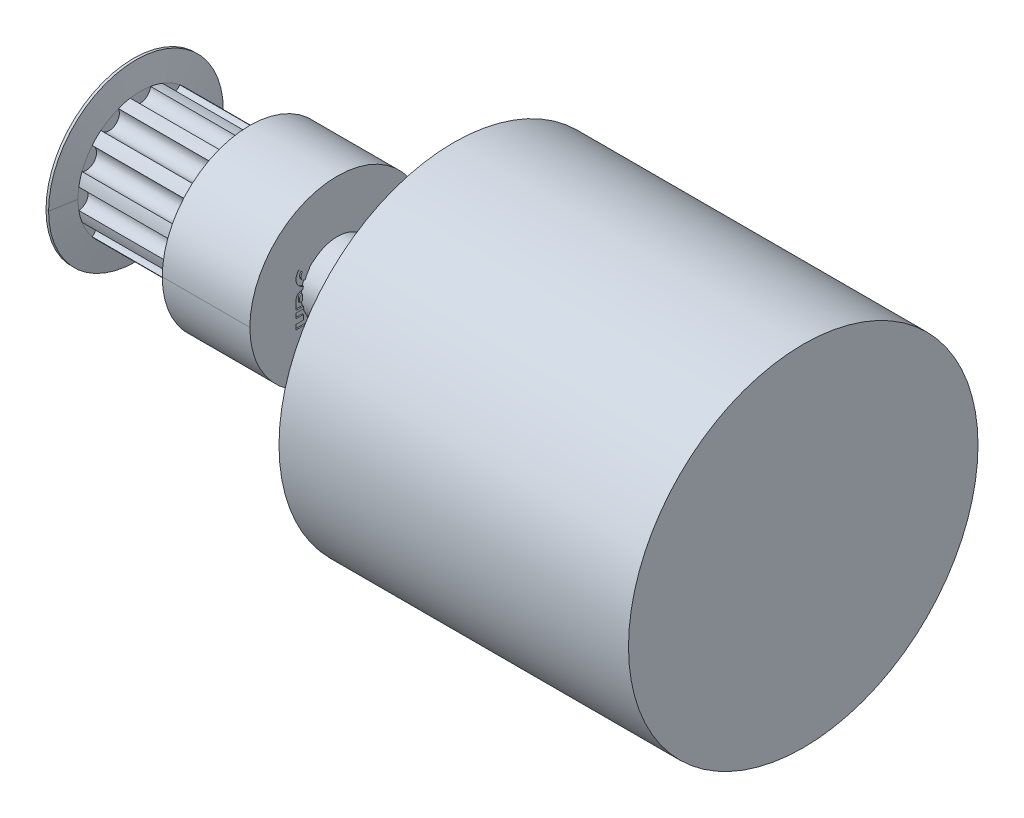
ISO-10303-21;
HEADER;
FILE_DESCRIPTION(('STEP AP214'),'2;1');
FILE_NAME('part.step','',(''),(''),'','','');
FILE_SCHEMA(('AUTOMOTIVE_DESIGN { 1 0 10303 214 1 1 1 1 }'));
ENDSEC;
DATA;
#1=APPLICATION_CONTEXT('core data for automotive mechanical design processes');
#2=APPLICATION_PROTOCOL_DEFINITION('international standard','automotive_design',2000,#1);
#3=PRODUCT_CONTEXT('',#1,'mechanical');
#4=PRODUCT('Part','Part','',(#3));
#5=PRODUCT_RELATED_PRODUCT_CATEGORY('part','',(#4));
#6=PRODUCT_DEFINITION_FORMATION('','',#4);
#7=PRODUCT_DEFINITION_CONTEXT('part definition',#1,'design');
#8=PRODUCT_DEFINITION('design','',#6,#7);
#9=PRODUCT_DEFINITION_SHAPE('','',#8);
#10=(LENGTH_UNIT() NAMED_UNIT(*) SI_UNIT(.MILLI.,.METRE.));
#11=(NAMED_UNIT(*) PLANE_ANGLE_UNIT() SI_UNIT($,.RADIAN.));
#12=(NAMED_UNIT(*) SI_UNIT($,.STERADIAN.) SOLID_ANGLE_UNIT());
#13=UNCERTAINTY_MEASURE_WITH_UNIT(LENGTH_MEASURE(1.E-05),#10,'distance_accuracy_value','');
#14=(GEOMETRIC_REPRESENTATION_CONTEXT(3) GLOBAL_UNCERTAINTY_ASSIGNED_CONTEXT((#13)) GLOBAL_UNIT_ASSIGNED_CONTEXT((#10,
#11,#12)) REPRESENTATION_CONTEXT('',''));
#15=CARTESIAN_POINT('',(0.,0.,0.));
#16=DIRECTION('',(0.,0.,1.));
#17=DIRECTION('',(1.,0.,0.));
#18=AXIS2_PLACEMENT_3D('',#15,#16,#17);
#19=CARTESIAN_POINT('',(33.9571831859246,153.215530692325,-72.8443636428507));
#20=DIRECTION('',(1.,0.,0.));
#21=DIRECTION('',(0.,0.,-1.));
#22=AXIS2_PLACEMENT_3D('',#19,#20,#21);
#23=CYLINDRICAL_SURFACE('',#22,0.208333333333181);
#24=CARTESIAN_POINT('',(34.0571831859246,153.215530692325,-72.8443636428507));
#25=DIRECTION('',(1.,0.,0.));
#26=DIRECTION('',(0.,0.,-1.));
#27=AXIS2_PLACEMENT_3D('',#24,#25,#26);
#28=CIRCLE('',#27,0.208333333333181);
#29=CARTESIAN_POINT('',(34.0571831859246,153.421759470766,-72.8739012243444));
#30=VERTEX_POINT('',#29);
#31=CARTESIAN_POINT('',(34.0571831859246,153.215530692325,-72.6360303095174));
#32=VERTEX_POINT('',#31);
#33=EDGE_CURVE('E155',#30,#32,#28,.T.);
#34=ORIENTED_EDGE('',*,*,#33,.F.);
#35=DIRECTION('',(-1.,0.,0.));
#36=VECTOR('',#35,1.);
#37=CARTESIAN_POINT('',(34.0071831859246,153.421759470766,-72.8739012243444));
#38=LINE('',#37,#36);
#39=CARTESIAN_POINT('',(33.9571831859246,153.421759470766,-72.8739012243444));
#40=VERTEX_POINT('',#39);
#41=EDGE_CURVE('E165',#30,#40,#38,.T.);
#42=ORIENTED_EDGE('',*,*,#41,.T.);
#43=CARTESIAN_POINT('',(33.9571831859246,153.215530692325,-72.8443636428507));
#44=DIRECTION('',(1.,0.,0.));
#45=DIRECTION('',(0.,0.,-1.));
#46=AXIS2_PLACEMENT_3D('',#43,#44,#45);
#47=CIRCLE('',#46,0.208333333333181);
#48=CARTESIAN_POINT('',(33.9571831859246,153.215530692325,-72.6360303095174));
#49=VERTEX_POINT('',#48);
#50=EDGE_CURVE('E441',#49,#40,#47,.F.);
#51=ORIENTED_EDGE('',*,*,#50,.F.);
#52=DIRECTION('',(1.,0.,0.));
#53=VECTOR('',#52,1.);
#54=CARTESIAN_POINT('',(34.0571831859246,153.215530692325,-72.6360303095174));
#55=LINE('',#54,#53);
#56=EDGE_CURVE('E452',#32,#49,#55,.F.);
#57=ORIENTED_EDGE('',*,*,#56,.F.);
#58=EDGE_LOOP('',(#34,#42,#51,#57));
#59=FACE_BOUND('',#58,.T.);
#60=ADVANCED_FACE('F38',(#59),#23,.T.);
#61=CARTESIAN_POINT('',(34.0571831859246,154.772879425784,-73.1568636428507));
#62=DIRECTION('',(-1.,0.,0.));
#63=DIRECTION('',(0.,-1.,0.));
#64=AXIS2_PLACEMENT_3D('',#61,#62,#63);
#65=CYLINDRICAL_SURFACE('',#64,0.833333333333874);
#66=CARTESIAN_POINT('',(33.9571831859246,154.772879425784,-73.1568636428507));
#67=DIRECTION('',(-1.,0.,0.));
#68=DIRECTION('',(0.,-1.,0.));
#69=AXIS2_PLACEMENT_3D('',#66,#67,#68);
#70=CIRCLE('',#69,0.833333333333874);
#71=CARTESIAN_POINT('',(33.9571831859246,155.338968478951,-73.7684089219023));
#72=VERTEX_POINT('',#71);
#73=CARTESIAN_POINT('',(33.9571831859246,155.362135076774,-73.7461192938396));
#74=VERTEX_POINT('',#73);
#75=EDGE_CURVE('E445',#72,#74,#70,.F.);
#76=ORIENTED_EDGE('',*,*,#75,.F.);
#77=DIRECTION('',(-1.,0.,0.));
#78=VECTOR('',#77,1.);
#79=CARTESIAN_POINT('',(34.0071831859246,155.338968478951,-73.7684089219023));
#80=LINE('',#79,#78);
#81=CARTESIAN_POINT('',(34.0571831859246,155.338968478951,-73.7684089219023));
#82=VERTEX_POINT('',#81);
#83=EDGE_CURVE('E361',#72,#82,#80,.F.);
#84=ORIENTED_EDGE('',*,*,#83,.T.);
#85=CARTESIAN_POINT('',(34.0571831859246,154.772879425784,-73.1568636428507));
#86=DIRECTION('',(-1.,0.,0.));
#87=DIRECTION('',(0.,-1.,0.));
#88=AXIS2_PLACEMENT_3D('',#85,#86,#87);
#89=CIRCLE('',#88,0.833333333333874);
#90=CARTESIAN_POINT('',(34.0571831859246,155.362135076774,-73.7461192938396));
#91=VERTEX_POINT('',#90);
#92=EDGE_CURVE('E353',#91,#82,#89,.T.);
#93=ORIENTED_EDGE('',*,*,#92,.F.);
#94=DIRECTION('',(1.,0.,0.));
#95=VECTOR('',#94,1.);
#96=CARTESIAN_POINT('',(34.0571831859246,155.362135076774,-73.7461192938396));
#97=LINE('',#96,#95);
#98=EDGE_CURVE('E357',#74,#91,#97,.T.);
#99=ORIENTED_EDGE('',*,*,#98,.F.);
#100=EDGE_LOOP('',(#76,#84,#93,#99));
#101=FACE_BOUND('',#100,.T.);
#102=ADVANCED_FACE('F356',(#101),#65,.F.);
#103=CARTESIAN_POINT('',(34.0571831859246,154.772879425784,-73.1568636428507));
#104=DIRECTION('',(-1.,0.,0.));
#105=DIRECTION('',(0.,-1.,0.));
#106=AXIS2_PLACEMENT_3D('',#103,#104,#105);
#107=CYLINDRICAL_SURFACE('',#106,0.833333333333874);
#108=CARTESIAN_POINT('',(34.0571831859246,154.772879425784,-73.1568636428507));
#109=DIRECTION('',(-1.,0.,0.));
#110=DIRECTION('',(0.,-1.,0.));
#111=AXIS2_PLACEMENT_3D('',#108,#109,#110);
#112=CIRCLE('',#111,0.833333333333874);
#113=CARTESIAN_POINT('',(34.0571831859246,153.961865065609,-72.9652908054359));
#114=VERTEX_POINT('',#113);
#115=CARTESIAN_POINT('',(34.0571831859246,155.362135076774,-72.5676079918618));
#116=VERTEX_POINT('',#115);
#117=EDGE_CURVE('E364',#114,#116,#112,.T.);
#118=ORIENTED_EDGE('',*,*,#117,.F.);
#119=DIRECTION('',(-1.,0.,0.));
#120=VECTOR('',#119,1.);
#121=CARTESIAN_POINT('',(34.0071831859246,153.961865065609,-72.9652908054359));
#122=LINE('',#121,#120);
#123=CARTESIAN_POINT('',(33.9571831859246,153.961865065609,-72.9652908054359));
#124=VERTEX_POINT('',#123);
#125=EDGE_CURVE('E885',#114,#124,#122,.T.);
#126=ORIENTED_EDGE('',*,*,#125,.T.);
#127=CARTESIAN_POINT('',(33.9571831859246,154.772879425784,-73.1568636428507));
#128=DIRECTION('',(-1.,0.,0.));
#129=DIRECTION('',(0.,-1.,0.));
#130=AXIS2_PLACEMENT_3D('',#127,#128,#129);
#131=CIRCLE('',#130,0.833333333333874);
#132=CARTESIAN_POINT('',(33.9571831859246,155.362135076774,-72.5676079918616));
#133=VERTEX_POINT('',#132);
#134=EDGE_CURVE('E679',#133,#124,#131,.F.);
#135=ORIENTED_EDGE('',*,*,#134,.F.);
#136=DIRECTION('',(1.,0.,0.));
#137=VECTOR('',#136,1.);
#138=CARTESIAN_POINT('',(34.0571831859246,155.362135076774,-72.5676079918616));
#139=LINE('',#138,#137);
#140=EDGE_CURVE('E374',#116,#133,#139,.F.);
#141=ORIENTED_EDGE('',*,*,#140,.F.);
#142=EDGE_LOOP('',(#118,#126,#135,#141));
#143=FACE_BOUND('',#142,.T.);
#144=ADVANCED_FACE('F921',(#143),#107,.F.);
#145=CARTESIAN_POINT('',(34.0571831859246,152.898768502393,-72.6360303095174));
#146=DIRECTION('',(1.,0.,0.));
#147=DIRECTION('',(0.,0.,-1.));
#148=AXIS2_PLACEMENT_3D('',#145,#146,#147);
#149=PLANE('',#148);
#150=DIRECTION('',(0.,0.,-1.));
#151=VECTOR('',#150,1.);
#152=CARTESIAN_POINT('',(34.0571831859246,152.898768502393,-73.0526969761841));
#153=LINE('',#152,#151);
#154=CARTESIAN_POINT('',(34.0571831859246,152.898768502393,-72.8796996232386));
#155=VERTEX_POINT('',#154);
#156=CARTESIAN_POINT('',(34.0571831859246,152.898768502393,-72.6360303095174));
#157=VERTEX_POINT('',#156);
#158=EDGE_CURVE('E450',#155,#157,#153,.F.);
#159=ORIENTED_EDGE('',*,*,#158,.F.);
#160=CARTESIAN_POINT('',(34.0571831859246,153.193396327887,-75.8651969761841));
#161=DIRECTION('',(1.,0.,0.));
#162=DIRECTION('',(0.,0.,-1.));
#163=AXIS2_PLACEMENT_3D('',#160,#161,#162);
#164=CIRCLE('',#163,3.);
#165=EDGE_CURVE('E685',#155,#30,#164,.F.);
#166=ORIENTED_EDGE('',*,*,#165,.T.);
#167=ORIENTED_EDGE('',*,*,#33,.T.);
#168=DIRECTION('',(0.,1.,0.));
#169=VECTOR('',#168,1.);
#170=CARTESIAN_POINT('',(34.0571831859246,152.898768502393,-72.6360303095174));
#171=LINE('',#170,#169);
#172=EDGE_CURVE('E466',#157,#32,#171,.T.);
#173=ORIENTED_EDGE('',*,*,#172,.F.);
#174=EDGE_LOOP('',(#159,#166,#167,#173));
#175=FACE_BOUND('',#174,.T.);
#176=ADVANCED_FACE('F925',(#175),#149,.T.);
#177=CARTESIAN_POINT('',(34.0571831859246,152.898768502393,-73.0526969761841));
#178=DIRECTION('',(0.,-1.,0.));
#179=DIRECTION('',(0.,0.,-1.));
#180=AXIS2_PLACEMENT_3D('',#177,#178,#179);
#181=PLANE('',#180);
#182=DIRECTION('',(0.,0.,-1.));
#183=VECTOR('',#182,1.);
#184=CARTESIAN_POINT('',(33.9571831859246,152.898768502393,-73.9901969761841));
#185=LINE('',#184,#183);
#186=CARTESIAN_POINT('',(33.9571831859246,152.898768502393,-72.8796996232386));
#187=VERTEX_POINT('',#186);
#188=CARTESIAN_POINT('',(33.9571831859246,152.898768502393,-72.6360303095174));
#189=VERTEX_POINT('',#188);
#190=EDGE_CURVE('E438',#187,#189,#185,.F.);
#191=ORIENTED_EDGE('',*,*,#190,.F.);
#192=DIRECTION('',(-1.,0.,0.));
#193=VECTOR('',#192,1.);
#194=CARTESIAN_POINT('',(9.60837574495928,152.898768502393,-72.8796996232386));
#195=LINE('',#194,#193);
#196=EDGE_CURVE('E689',#187,#155,#195,.F.);
#197=ORIENTED_EDGE('',*,*,#196,.T.);
#198=ORIENTED_EDGE('',*,*,#158,.T.);
#199=DIRECTION('',(1.,0.,0.));
#200=VECTOR('',#199,1.);
#201=CARTESIAN_POINT('',(34.0571831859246,152.898768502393,-72.6360303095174));
#202=LINE('',#201,#200);
#203=EDGE_CURVE('E446',#157,#189,#202,.F.);
#204=ORIENTED_EDGE('',*,*,#203,.T.);
#205=EDGE_LOOP('',(#191,#197,#198,#204));
#206=FACE_BOUND('',#205,.T.);
#207=ADVANCED_FACE('F911',(#206),#181,.T.);
#208=CARTESIAN_POINT('',(33.9571831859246,152.482101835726,-73.9901969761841));
#209=DIRECTION('',(1.,0.,0.));
#210=DIRECTION('',(0.,0.,-1.));
#211=AXIS2_PLACEMENT_3D('',#208,#209,#210);
#212=PLANE('',#211);
#213=DIRECTION('',(0.,0.,1.));
#214=VECTOR('',#213,1.);
#215=CARTESIAN_POINT('',(33.9571831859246,152.482101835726,-72.3235303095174));
#216=LINE('',#215,#214);
#217=CARTESIAN_POINT('',(33.9571831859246,152.482101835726,-72.9507398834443));
#218=VERTEX_POINT('',#217);
#219=CARTESIAN_POINT('',(33.9571831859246,152.482101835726,-72.3235303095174));
#220=VERTEX_POINT('',#219);
#221=EDGE_CURVE('E409',#218,#220,#216,.T.);
#222=ORIENTED_EDGE('',*,*,#221,.F.);
#223=CARTESIAN_POINT('',(33.9571831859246,153.193396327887,-75.8651969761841));
#224=DIRECTION('',(1.,0.,0.));
#225=DIRECTION('',(0.,0.,-1.));
#226=AXIS2_PLACEMENT_3D('',#223,#224,#225);
#227=CIRCLE('',#226,3.);
#228=EDGE_CURVE('E896',#218,#187,#227,.F.);
#229=ORIENTED_EDGE('',*,*,#228,.T.);
#230=ORIENTED_EDGE('',*,*,#190,.T.);
#231=DIRECTION('',(0.,1.,0.));
#232=VECTOR('',#231,1.);
#233=CARTESIAN_POINT('',(33.9571831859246,152.482101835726,-72.6360303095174));
#234=LINE('',#233,#232);
#235=EDGE_CURVE('E449',#189,#49,#234,.T.);
#236=ORIENTED_EDGE('',*,*,#235,.T.);
#237=ORIENTED_EDGE('',*,*,#50,.T.);
#238=CARTESIAN_POINT('',(33.9571831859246,153.731702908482,-72.9138877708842));
#239=VERTEX_POINT('',#238);
#240=EDGE_CURVE('E894',#40,#239,#227,.F.);
#241=ORIENTED_EDGE('',*,*,#240,.T.);
#242=CARTESIAN_POINT('',(33.9571831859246,153.215530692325,-72.8443636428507));
#243=DIRECTION('',(-1.,0.,0.));
#244=DIRECTION('',(0.,-1.,0.));
#245=AXIS2_PLACEMENT_3D('',#242,#243,#244);
#246=CIRCLE('',#245,0.520833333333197);
#247=CARTESIAN_POINT('',(33.9571831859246,153.215530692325,-72.3235303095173));
#248=VERTEX_POINT('',#247);
#249=EDGE_CURVE('E404',#248,#239,#246,.T.);
#250=ORIENTED_EDGE('',*,*,#249,.F.);
#251=DIRECTION('',(0.,1.,0.));
#252=VECTOR('',#251,1.);
#253=CARTESIAN_POINT('',(33.9571831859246,153.215530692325,-72.3235303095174));
#254=LINE('',#253,#252);
#255=EDGE_CURVE('E408',#220,#248,#254,.T.);
#256=ORIENTED_EDGE('',*,*,#255,.F.);
#257=EDGE_LOOP('',(#222,#229,#230,#236,#237,#241,#250,#256));
#258=FACE_BOUND('',#257,.T.);
#259=ADVANCED_FACE('F906',(#258),#212,.T.);
#260=CARTESIAN_POINT('',(33.9571831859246,153.939546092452,-73.9901969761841));
#261=DIRECTION('',(1.,0.,0.));
#262=DIRECTION('',(0.,0.,-1.));
#263=AXIS2_PLACEMENT_3D('',#260,#261,#262);
#264=PLANE('',#263);
#265=ORIENTED_EDGE('',*,*,#134,.T.);
#266=CARTESIAN_POINT('',(33.9571831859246,153.193396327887,-75.8651969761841));
#267=DIRECTION('',(1.,0.,0.));
#268=DIRECTION('',(0.,0.,-1.));
#269=AXIS2_PLACEMENT_3D('',#266,#267,#268);
#270=CIRCLE('',#269,3.);
#271=CARTESIAN_POINT('',(33.9571831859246,154.359935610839,-73.1012892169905));
#272=VERTEX_POINT('',#271);
#273=EDGE_CURVE('E884',#124,#272,#270,.F.);
#274=ORIENTED_EDGE('',*,*,#273,.T.);
#275=CARTESIAN_POINT('',(33.9571831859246,154.772879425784,-73.1568636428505));
#276=DIRECTION('',(1.,0.,0.));
#277=DIRECTION('',(0.,0.,-1.));
#278=AXIS2_PLACEMENT_3D('',#275,#276,#277);
#279=CIRCLE('',#278,0.416666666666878);
#280=CARTESIAN_POINT('',(33.9571831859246,154.47825160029,-72.8622358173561));
#281=VERTEX_POINT('',#280);
#282=EDGE_CURVE('E392',#281,#272,#279,.T.);
#283=ORIENTED_EDGE('',*,*,#282,.F.);
#284=CARTESIAN_POINT('',(33.9571831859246,154.772879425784,-73.1568636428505));
#285=DIRECTION('',(1.,0.,0.));
#286=DIRECTION('',(0.,0.,-1.));
#287=AXIS2_PLACEMENT_3D('',#284,#285,#286);
#288=CIRCLE('',#287,0.416666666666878);
#289=CARTESIAN_POINT('',(33.9571831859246,155.067507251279,-72.8622358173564));
#290=VERTEX_POINT('',#289);
#291=EDGE_CURVE('E440',#281,#290,#288,.F.);
#292=ORIENTED_EDGE('',*,*,#291,.T.);
#293=DIRECTION('',(0.,-0.707106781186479,-0.707106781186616));
#294=VECTOR('',#293,1.);
#295=CARTESIAN_POINT('',(33.9571831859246,155.067507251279,-72.8622358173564));
#296=LINE('',#295,#294);
#297=EDGE_CURVE('E455',#133,#290,#296,.T.);
#298=ORIENTED_EDGE('',*,*,#297,.F.);
#299=EDGE_LOOP('',(#265,#274,#283,#292,#298));
#300=FACE_BOUND('',#299,.T.);
#301=ADVANCED_FACE('F943',(#300),#264,.T.);
#302=CARTESIAN_POINT('',(33.9571831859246,155.024586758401,-73.4889096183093));
#303=VERTEX_POINT('',#302);
#304=CARTESIAN_POINT('',(33.9571831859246,155.067507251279,-73.4514914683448));
#305=VERTEX_POINT('',#304);
#306=EDGE_CURVE('E395',#303,#305,#279,.T.);
#307=ORIENTED_EDGE('',*,*,#306,.F.);
#308=EDGE_CURVE('E878',#303,#72,#270,.F.);
#309=ORIENTED_EDGE('',*,*,#308,.T.);
#310=ORIENTED_EDGE('',*,*,#75,.T.);
#311=DIRECTION('',(0.,0.707106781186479,-0.707106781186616));
#312=VECTOR('',#311,1.);
#313=CARTESIAN_POINT('',(33.9571831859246,155.362135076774,-73.7461192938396));
#314=LINE('',#313,#312);
#315=EDGE_CURVE('E373',#305,#74,#314,.T.);
#316=ORIENTED_EDGE('',*,*,#315,.F.);
#317=EDGE_LOOP('',(#307,#309,#310,#316));
#318=FACE_BOUND('',#317,.T.);
#319=ADVANCED_FACE('F946',(#318),#264,.T.);
#320=CARTESIAN_POINT('',(33.9571831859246,151.024657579,-73.9901969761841));
#321=DIRECTION('',(1.,0.,0.));
#322=DIRECTION('',(0.,0.,-1.));
#323=AXIS2_PLACEMENT_3D('',#320,#321,#322);
#324=PLANE('',#323);
#325=DIRECTION('',(0.,0.,1.));
#326=VECTOR('',#325,1.);
#327=CARTESIAN_POINT('',(33.9571831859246,151.024657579,-72.3235303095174));
#328=LINE('',#327,#326);
#329=CARTESIAN_POINT('',(33.9571831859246,151.024657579,-73.792379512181));
#330=VERTEX_POINT('',#329);
#331=CARTESIAN_POINT('',(33.9571831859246,151.024657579,-72.3235303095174));
#332=VERTEX_POINT('',#331);
#333=EDGE_CURVE('E831',#330,#332,#328,.T.);
#334=ORIENTED_EDGE('',*,*,#333,.F.);
#335=CARTESIAN_POINT('',(33.9571831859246,153.193396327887,-75.8651969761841));
#336=DIRECTION('',(1.,0.,0.));
#337=DIRECTION('',(0.,0.,-1.));
#338=AXIS2_PLACEMENT_3D('',#335,#336,#337);
#339=CIRCLE('',#338,3.);
#340=CARTESIAN_POINT('',(33.9571831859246,151.441324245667,-73.4299878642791));
#341=VERTEX_POINT('',#340);
#342=EDGE_CURVE('E856',#330,#341,#339,.F.);
#343=ORIENTED_EDGE('',*,*,#342,.T.);
#344=DIRECTION('',(0.,0.,-1.));
#345=VECTOR('',#344,1.);
#346=CARTESIAN_POINT('',(33.9571831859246,151.441324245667,-73.9901969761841));
#347=LINE('',#346,#345);
#348=CARTESIAN_POINT('',(33.9571831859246,151.441324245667,-73.3651969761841));
#349=VERTEX_POINT('',#348);
#350=EDGE_CURVE('E388',#349,#341,#347,.T.);
#351=ORIENTED_EDGE('',*,*,#350,.F.);
#352=DIRECTION('',(0.,1.,0.));
#353=VECTOR('',#352,1.);
#354=CARTESIAN_POINT('',(33.9571831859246,151.441324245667,-73.3651969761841));
#355=LINE('',#354,#353);
#356=CARTESIAN_POINT('',(33.9571831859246,151.535083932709,-73.3651969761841));
#357=VERTEX_POINT('',#356);
#358=EDGE_CURVE('E799',#357,#349,#355,.F.);
#359=ORIENTED_EDGE('',*,*,#358,.F.);
#360=CARTESIAN_POINT('',(33.9571831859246,152.274657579,-73.0093399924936));
#361=VERTEX_POINT('',#360);
#362=EDGE_CURVE('E858',#357,#361,#339,.F.);
#363=ORIENTED_EDGE('',*,*,#362,.T.);
#364=DIRECTION('',(0.,0.,-1.));
#365=VECTOR('',#364,1.);
#366=CARTESIAN_POINT('',(33.9571831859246,152.274657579,-73.9901969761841));
#367=LINE('',#366,#365);
#368=CARTESIAN_POINT('',(33.9571831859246,152.274657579,-72.3235303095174));
#369=VERTEX_POINT('',#368);
#370=EDGE_CURVE('E801',#369,#361,#367,.T.);
#371=ORIENTED_EDGE('',*,*,#370,.F.);
#372=DIRECTION('',(0.,1.,0.));
#373=VECTOR('',#372,1.);
#374=CARTESIAN_POINT('',(33.9571831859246,152.274657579,-72.3235303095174));
#375=LINE('',#374,#373);
#376=CARTESIAN_POINT('',(33.9571831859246,151.857990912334,-72.3235303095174));
#377=VERTEX_POINT('',#376);
#378=EDGE_CURVE('E807',#377,#369,#375,.T.);
#379=ORIENTED_EDGE('',*,*,#378,.F.);
#380=DIRECTION('',(0.,0.,1.));
#381=VECTOR('',#380,1.);
#382=CARTESIAN_POINT('',(33.9571831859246,151.857990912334,-72.3235303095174));
#383=LINE('',#382,#381);
#384=CARTESIAN_POINT('',(33.9571831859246,151.857990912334,-72.9485303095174));
#385=VERTEX_POINT('',#384);
#386=EDGE_CURVE('E812',#385,#377,#383,.T.);
#387=ORIENTED_EDGE('',*,*,#386,.F.);
#388=DIRECTION('',(0.,1.,0.));
#389=VECTOR('',#388,1.);
#390=CARTESIAN_POINT('',(33.9571831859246,151.857990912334,-72.9485303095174));
#391=LINE('',#390,#389);
#392=CARTESIAN_POINT('',(33.9571831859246,151.441324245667,-72.9485303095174));
#393=VERTEX_POINT('',#392);
#394=EDGE_CURVE('E817',#393,#385,#391,.T.);
#395=ORIENTED_EDGE('',*,*,#394,.F.);
#396=DIRECTION('',(0.,0.,-1.));
#397=VECTOR('',#396,1.);
#398=CARTESIAN_POINT('',(33.9571831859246,151.441324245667,-72.9485303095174));
#399=LINE('',#398,#397);
#400=CARTESIAN_POINT('',(33.9571831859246,151.441324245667,-72.3235303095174));
#401=VERTEX_POINT('',#400);
#402=EDGE_CURVE('E822',#401,#393,#399,.T.);
#403=ORIENTED_EDGE('',*,*,#402,.F.);
#404=DIRECTION('',(0.,1.,0.));
#405=VECTOR('',#404,1.);
#406=CARTESIAN_POINT('',(33.9571831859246,151.441324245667,-72.3235303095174));
#407=LINE('',#406,#405);
#408=EDGE_CURVE('E827',#332,#401,#407,.T.);
#409=ORIENTED_EDGE('',*,*,#408,.F.);
#410=EDGE_LOOP('',(#334,#343,#351,#359,#363,#371,#379,#387,#395,#403,#409));
#411=FACE_BOUND('',#410,.T.);
#412=ADVANCED_FACE('F853',(#411),#324,.T.);
#413=CARTESIAN_POINT('',(34.0571831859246,152.482101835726,-72.3235303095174));
#414=DIRECTION('',(0.,1.,0.));
#415=DIRECTION('',(0.,0.,1.));
#416=AXIS2_PLACEMENT_3D('',#413,#414,#415);
#417=PLANE('',#416);
#418=DIRECTION('',(0.,0.,-1.));
#419=VECTOR('',#418,1.);
#420=CARTESIAN_POINT('',(34.0571831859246,152.482101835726,-68.3651969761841));
#421=LINE('',#420,#419);
#422=CARTESIAN_POINT('',(34.0571831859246,152.482101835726,-72.9507398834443));
#423=VERTEX_POINT('',#422);
#424=CARTESIAN_POINT('',(34.0571831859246,152.482101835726,-72.3235303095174));
#425=VERTEX_POINT('',#424);
#426=EDGE_CURVE('E400',#423,#425,#421,.F.);
#427=ORIENTED_EDGE('',*,*,#426,.F.);
#428=DIRECTION('',(-1.,0.,0.));
#429=VECTOR('',#428,1.);
#430=CARTESIAN_POINT('',(9.60837574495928,152.482101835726,-72.9507398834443));
#431=LINE('',#430,#429);
#432=EDGE_CURVE('E891',#423,#218,#431,.T.);
#433=ORIENTED_EDGE('',*,*,#432,.T.);
#434=ORIENTED_EDGE('',*,*,#221,.T.);
#435=DIRECTION('',(-1.,0.,0.));
#436=VECTOR('',#435,1.);
#437=CARTESIAN_POINT('',(34.0571831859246,152.482101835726,-72.3235303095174));
#438=LINE('',#437,#436);
#439=EDGE_CURVE('E405',#425,#220,#438,.T.);
#440=ORIENTED_EDGE('',*,*,#439,.F.);
#441=EDGE_LOOP('',(#427,#433,#434,#440));
#442=FACE_BOUND('',#441,.T.);
#443=ADVANCED_FACE('F950',(#442),#417,.T.);
#444=CARTESIAN_POINT('',(34.0571831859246,153.215530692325,-72.8443636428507));
#445=DIRECTION('',(-1.,0.,0.));
#446=DIRECTION('',(0.,-1.,0.));
#447=AXIS2_PLACEMENT_3D('',#444,#445,#446);
#448=CYLINDRICAL_SURFACE('',#447,0.520833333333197);
#449=ORIENTED_EDGE('',*,*,#249,.T.);
#450=DIRECTION('',(-1.,0.,0.));
#451=VECTOR('',#450,1.);
#452=CARTESIAN_POINT('',(38.0571831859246,153.731702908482,-72.9138877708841));
#453=LINE('',#452,#451);
#454=CARTESIAN_POINT('',(34.0571831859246,153.731702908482,-72.9138877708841));
#455=VERTEX_POINT('',#454);
#456=EDGE_CURVE('E888',#239,#455,#453,.F.);
#457=ORIENTED_EDGE('',*,*,#456,.T.);
#458=CARTESIAN_POINT('',(34.0571831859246,153.215530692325,-72.8443636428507));
#459=DIRECTION('',(-1.,0.,0.));
#460=DIRECTION('',(0.,-1.,0.));
#461=AXIS2_PLACEMENT_3D('',#458,#459,#460);
#462=CIRCLE('',#461,0.520833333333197);
#463=CARTESIAN_POINT('',(34.0571831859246,153.215530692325,-72.3235303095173));
#464=VERTEX_POINT('',#463);
#465=EDGE_CURVE('E381',#464,#455,#462,.T.);
#466=ORIENTED_EDGE('',*,*,#465,.F.);
#467=DIRECTION('',(-1.,0.,0.));
#468=VECTOR('',#467,1.);
#469=CARTESIAN_POINT('',(34.0071831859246,153.215530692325,-72.3235303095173));
#470=LINE('',#469,#468);
#471=EDGE_CURVE('E401',#464,#248,#470,.T.);
#472=ORIENTED_EDGE('',*,*,#471,.T.);
#473=EDGE_LOOP('',(#449,#457,#466,#472));
#474=FACE_BOUND('',#473,.T.);
#475=ADVANCED_FACE('F992',(#474),#448,.F.);
#476=CARTESIAN_POINT('',(33.9571831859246,154.772879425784,-73.1568636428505));
#477=DIRECTION('',(1.,0.,0.));
#478=DIRECTION('',(0.,0.,-1.));
#479=AXIS2_PLACEMENT_3D('',#476,#477,#478);
#480=CYLINDRICAL_SURFACE('',#479,0.416666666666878);
#481=CARTESIAN_POINT('',(34.0571831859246,154.772879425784,-73.1568636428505));
#482=DIRECTION('',(1.,0.,0.));
#483=DIRECTION('',(0.,0.,-1.));
#484=AXIS2_PLACEMENT_3D('',#481,#482,#483);
#485=CIRCLE('',#484,0.416666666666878);
#486=CARTESIAN_POINT('',(34.0571831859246,155.024586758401,-73.4889096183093));
#487=VERTEX_POINT('',#486);
#488=CARTESIAN_POINT('',(34.0571831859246,155.067507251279,-73.451491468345));
#489=VERTEX_POINT('',#488);
#490=EDGE_CURVE('E380',#487,#489,#485,.T.);
#491=ORIENTED_EDGE('',*,*,#490,.F.);
#492=DIRECTION('',(-1.,0.,0.));
#493=VECTOR('',#492,1.);
#494=CARTESIAN_POINT('',(38.0571831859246,155.024586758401,-73.4889096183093));
#495=LINE('',#494,#493);
#496=EDGE_CURVE('E863',#487,#303,#495,.T.);
#497=ORIENTED_EDGE('',*,*,#496,.T.);
#498=ORIENTED_EDGE('',*,*,#306,.T.);
#499=DIRECTION('',(1.,0.,0.));
#500=VECTOR('',#499,1.);
#501=CARTESIAN_POINT('',(34.0071831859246,155.067507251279,-73.4514914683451));
#502=LINE('',#501,#500);
#503=EDGE_CURVE('E390',#305,#489,#502,.T.);
#504=ORIENTED_EDGE('',*,*,#503,.T.);
#505=EDGE_LOOP('',(#491,#497,#498,#504));
#506=FACE_BOUND('',#505,.T.);
#507=ADVANCED_FACE('F999',(#506),#480,.T.);
#508=ORIENTED_EDGE('',*,*,#282,.T.);
#509=DIRECTION('',(-1.,0.,0.));
#510=VECTOR('',#509,1.);
#511=CARTESIAN_POINT('',(38.0571831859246,154.359935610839,-73.1012892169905));
#512=LINE('',#511,#510);
#513=CARTESIAN_POINT('',(34.0571831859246,154.359935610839,-73.1012892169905));
#514=VERTEX_POINT('',#513);
#515=EDGE_CURVE('E868',#272,#514,#512,.F.);
#516=ORIENTED_EDGE('',*,*,#515,.T.);
#517=CARTESIAN_POINT('',(34.0571831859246,154.47825160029,-72.8622358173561));
#518=VERTEX_POINT('',#517);
#519=EDGE_CURVE('E638',#518,#514,#485,.T.);
#520=ORIENTED_EDGE('',*,*,#519,.F.);
#521=DIRECTION('',(-1.,0.,0.));
#522=VECTOR('',#521,1.);
#523=CARTESIAN_POINT('',(34.0071831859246,154.47825160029,-72.8622358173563));
#524=LINE('',#523,#522);
#525=EDGE_CURVE('E393',#518,#281,#524,.T.);
#526=ORIENTED_EDGE('',*,*,#525,.T.);
#527=EDGE_LOOP('',(#508,#516,#520,#526));
#528=FACE_BOUND('',#527,.T.);
#529=ADVANCED_FACE('F1010',(#528),#480,.T.);
#530=CARTESIAN_POINT('',(34.0571831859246,151.441324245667,-73.9901969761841));
#531=DIRECTION('',(0.,-1.,0.));
#532=DIRECTION('',(0.,0.,-1.));
#533=AXIS2_PLACEMENT_3D('',#530,#531,#532);
#534=PLANE('',#533);
#535=ORIENTED_EDGE('',*,*,#350,.T.);
#536=DIRECTION('',(-1.,0.,0.));
#537=VECTOR('',#536,1.);
#538=CARTESIAN_POINT('',(9.60837574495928,151.441324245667,-73.4299878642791));
#539=LINE('',#538,#537);
#540=CARTESIAN_POINT('',(34.0571831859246,151.441324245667,-73.4299878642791));
#541=VERTEX_POINT('',#540);
#542=EDGE_CURVE('E846',#341,#541,#539,.F.);
#543=ORIENTED_EDGE('',*,*,#542,.T.);
#544=DIRECTION('',(0.,0.,-1.));
#545=VECTOR('',#544,1.);
#546=CARTESIAN_POINT('',(34.0571831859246,151.441324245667,-68.3651969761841));
#547=LINE('',#546,#545);
#548=CARTESIAN_POINT('',(34.0571831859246,151.441324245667,-73.3651969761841));
#549=VERTEX_POINT('',#548);
#550=EDGE_CURVE('E641',#549,#541,#547,.T.);
#551=ORIENTED_EDGE('',*,*,#550,.F.);
#552=DIRECTION('',(1.,0.,0.));
#553=VECTOR('',#552,1.);
#554=CARTESIAN_POINT('',(34.0571831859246,151.441324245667,-73.3651969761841));
#555=LINE('',#554,#553);
#556=EDGE_CURVE('E673',#349,#549,#555,.T.);
#557=ORIENTED_EDGE('',*,*,#556,.F.);
#558=EDGE_LOOP('',(#535,#543,#551,#557));
#559=FACE_BOUND('',#558,.T.);
#560=ADVANCED_FACE('F842',(#559),#534,.T.);
#561=CARTESIAN_POINT('',(34.0571831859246,151.024657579,-72.3235303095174));
#562=DIRECTION('',(0.,1.,0.));
#563=DIRECTION('',(0.,0.,1.));
#564=AXIS2_PLACEMENT_3D('',#561,#562,#563);
#565=PLANE('',#564);
#566=DIRECTION('',(0.,0.,-1.));
#567=VECTOR('',#566,1.);
#568=CARTESIAN_POINT('',(34.0571831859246,151.024657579,-68.3651969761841));
#569=LINE('',#568,#567);
#570=CARTESIAN_POINT('',(34.0571831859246,151.024657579,-73.792379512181));
#571=VERTEX_POINT('',#570);
#572=CARTESIAN_POINT('',(34.0571831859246,151.024657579,-72.3235303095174));
#573=VERTEX_POINT('',#572);
#574=EDGE_CURVE('E780',#571,#573,#569,.F.);
#575=ORIENTED_EDGE('',*,*,#574,.F.);
#576=DIRECTION('',(-1.,0.,0.));
#577=VECTOR('',#576,1.);
#578=CARTESIAN_POINT('',(9.60837574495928,151.024657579,-73.792379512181));
#579=LINE('',#578,#577);
#580=EDGE_CURVE('E53',#571,#330,#579,.T.);
#581=ORIENTED_EDGE('',*,*,#580,.T.);
#582=ORIENTED_EDGE('',*,*,#333,.T.);
#583=DIRECTION('',(-1.,0.,0.));
#584=VECTOR('',#583,1.);
#585=CARTESIAN_POINT('',(34.0571831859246,151.024657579,-72.3235303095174));
#586=LINE('',#585,#584);
#587=EDGE_CURVE('E829',#573,#332,#586,.T.);
#588=ORIENTED_EDGE('',*,*,#587,.F.);
#589=EDGE_LOOP('',(#575,#581,#582,#588));
#590=FACE_BOUND('',#589,.T.);
#591=ADVANCED_FACE('F1013',(#590),#565,.T.);
#592=CARTESIAN_POINT('',(34.0571831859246,152.274657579,-73.9901969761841));
#593=DIRECTION('',(0.,-1.,0.));
#594=DIRECTION('',(0.,0.,-1.));
#595=AXIS2_PLACEMENT_3D('',#592,#593,#594);
#596=PLANE('',#595);
#597=ORIENTED_EDGE('',*,*,#370,.T.);
#598=DIRECTION('',(-1.,0.,0.));
#599=VECTOR('',#598,1.);
#600=CARTESIAN_POINT('',(9.60837574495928,152.274657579,-73.0093399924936));
#601=LINE('',#600,#599);
#602=CARTESIAN_POINT('',(34.0571831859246,152.274657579,-73.0093399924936));
#603=VERTEX_POINT('',#602);
#604=EDGE_CURVE('E862',#361,#603,#601,.F.);
#605=ORIENTED_EDGE('',*,*,#604,.T.);
#606=DIRECTION('',(0.,0.,-1.));
#607=VECTOR('',#606,1.);
#608=CARTESIAN_POINT('',(34.0571831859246,152.274657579,-68.3651969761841));
#609=LINE('',#608,#607);
#610=CARTESIAN_POINT('',(34.0571831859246,152.274657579,-72.3235303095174));
#611=VERTEX_POINT('',#610);
#612=EDGE_CURVE('E763',#611,#603,#609,.T.);
#613=ORIENTED_EDGE('',*,*,#612,.F.);
#614=DIRECTION('',(1.,0.,0.));
#615=VECTOR('',#614,1.);
#616=CARTESIAN_POINT('',(34.0571831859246,152.274657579,-72.3235303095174));
#617=LINE('',#616,#615);
#618=EDGE_CURVE('E804',#611,#369,#617,.F.);
#619=ORIENTED_EDGE('',*,*,#618,.T.);
#620=EDGE_LOOP('',(#597,#605,#613,#619));
#621=FACE_BOUND('',#620,.T.);
#622=ADVANCED_FACE('F1016',(#621),#596,.T.);
#623=CARTESIAN_POINT('',(34.0571831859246,151.441324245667,-73.3651969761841));
#624=DIRECTION('',(0.,0.,1.));
#625=DIRECTION('',(1.,0.,0.));
#626=AXIS2_PLACEMENT_3D('',#623,#624,#625);
#627=PLANE('',#626);
#628=DIRECTION('',(0.,1.,0.));
#629=VECTOR('',#628,1.);
#630=CARTESIAN_POINT('',(34.0571831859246,145.693396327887,-73.3651969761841));
#631=LINE('',#630,#629);
#632=CARTESIAN_POINT('',(34.0571831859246,151.535083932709,-73.3651969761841));
#633=VERTEX_POINT('',#632);
#634=EDGE_CURVE('E637',#633,#549,#631,.F.);
#635=ORIENTED_EDGE('',*,*,#634,.F.);
#636=DIRECTION('',(-1.,0.,0.));
#637=VECTOR('',#636,1.);
#638=CARTESIAN_POINT('',(9.60837574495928,151.535083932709,-73.3651969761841));
#639=LINE('',#638,#637);
#640=EDGE_CURVE('E871',#633,#357,#639,.T.);
#641=ORIENTED_EDGE('',*,*,#640,.T.);
#642=ORIENTED_EDGE('',*,*,#358,.T.);
#643=ORIENTED_EDGE('',*,*,#556,.T.);
#644=EDGE_LOOP('',(#635,#641,#642,#643));
#645=FACE_BOUND('',#644,.T.);
#646=ADVANCED_FACE('F1039',(#645),#627,.T.);
#647=CARTESIAN_POINT('',(34.0571831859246,145.693396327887,-68.3651969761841));
#648=DIRECTION('',(1.,0.,0.));
#649=DIRECTION('',(0.,0.,-1.));
#650=AXIS2_PLACEMENT_3D('',#647,#648,#649);
#651=PLANE('',#650);
#652=ORIENTED_EDGE('',*,*,#550,.T.);
#653=CARTESIAN_POINT('',(34.0571831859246,153.193396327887,-75.8651969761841));
#654=DIRECTION('',(1.,0.,0.));
#655=DIRECTION('',(0.,0.,-1.));
#656=AXIS2_PLACEMENT_3D('',#653,#654,#655);
#657=CIRCLE('',#656,3.);
#658=EDGE_CURVE('E11',#541,#633,#657,.F.);
#659=ORIENTED_EDGE('',*,*,#658,.T.);
#660=ORIENTED_EDGE('',*,*,#634,.T.);
#661=EDGE_LOOP('',(#652,#659,#660));
#662=FACE_BOUND('',#661,.T.);
#663=ADVANCED_FACE('F1043',(#662),#651,.T.);
#664=CARTESIAN_POINT('',(34.0571831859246,153.193396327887,-75.8651969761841));
#665=DIRECTION('',(1.,0.,0.));
#666=DIRECTION('',(0.,0.,-1.));
#667=AXIS2_PLACEMENT_3D('',#664,#665,#666);
#668=CIRCLE('',#667,7.50000000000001);
#669=CARTESIAN_POINT('',(34.0571831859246,153.193396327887,-68.3651969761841));
#670=VERTEX_POINT('',#669);
#671=CARTESIAN_POINT('',(34.0571831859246,153.193396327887,-83.3651969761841));
#672=VERTEX_POINT('',#671);
#673=EDGE_CURVE('E610',#670,#672,#668,.F.);
#674=ORIENTED_EDGE('',*,*,#673,.F.);
#675=CARTESIAN_POINT('',(34.0571831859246,153.193396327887,-75.8651969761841));
#676=DIRECTION('',(1.,0.,0.));
#677=DIRECTION('',(0.,0.,-1.));
#678=AXIS2_PLACEMENT_3D('',#675,#676,#677);
#679=CIRCLE('',#678,7.50000000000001);
#680=EDGE_CURVE('E635',#672,#670,#679,.F.);
#681=ORIENTED_EDGE('',*,*,#680,.F.);
#682=EDGE_LOOP('',(#674,#681));
#683=FACE_BOUND('',#682,.T.);
#684=ORIENTED_EDGE('',*,*,#612,.T.);
#685=EDGE_CURVE('E46',#603,#423,#657,.F.);
#686=ORIENTED_EDGE('',*,*,#685,.T.);
#687=ORIENTED_EDGE('',*,*,#426,.T.);
#688=DIRECTION('',(0.,1.,0.));
#689=VECTOR('',#688,1.);
#690=CARTESIAN_POINT('',(34.0571831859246,145.693396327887,-72.3235303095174));
#691=LINE('',#690,#689);
#692=EDGE_CURVE('E384',#425,#464,#691,.T.);
#693=ORIENTED_EDGE('',*,*,#692,.T.);
#694=ORIENTED_EDGE('',*,*,#465,.T.);
#695=EDGE_CURVE('E1926',#455,#114,#657,.F.);
#696=ORIENTED_EDGE('',*,*,#695,.T.);
#697=ORIENTED_EDGE('',*,*,#117,.T.);
#698=DIRECTION('',(0.,-0.707106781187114,-0.707106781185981));
#699=VECTOR('',#698,1.);
#700=CARTESIAN_POINT('',(34.0571831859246,155.362135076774,-72.5676079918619));
#701=LINE('',#700,#699);
#702=CARTESIAN_POINT('',(34.0571831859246,155.067507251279,-72.8622358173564));
#703=VERTEX_POINT('',#702);
#704=EDGE_CURVE('E456',#116,#703,#701,.T.);
#705=ORIENTED_EDGE('',*,*,#704,.T.);
#706=CARTESIAN_POINT('',(34.0571831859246,154.772879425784,-73.1568636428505));
#707=DIRECTION('',(1.,0.,0.));
#708=DIRECTION('',(0.,0.,-1.));
#709=AXIS2_PLACEMENT_3D('',#706,#707,#708);
#710=CIRCLE('',#709,0.416666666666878);
#711=EDGE_CURVE('E459',#703,#518,#710,.T.);
#712=ORIENTED_EDGE('',*,*,#711,.T.);
#713=ORIENTED_EDGE('',*,*,#519,.T.);
#714=EDGE_CURVE('E1935',#514,#487,#657,.F.);
#715=ORIENTED_EDGE('',*,*,#714,.T.);
#716=ORIENTED_EDGE('',*,*,#490,.T.);
#717=DIRECTION('',(0.,0.707106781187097,-0.707106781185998));
#718=VECTOR('',#717,1.);
#719=CARTESIAN_POINT('',(34.0571831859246,155.067507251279,-73.4514914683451));
#720=LINE('',#719,#718);
#721=EDGE_CURVE('E365',#489,#91,#720,.T.);
#722=ORIENTED_EDGE('',*,*,#721,.T.);
#723=ORIENTED_EDGE('',*,*,#92,.T.);
#724=EDGE_CURVE('E41',#82,#571,#657,.F.);
#725=ORIENTED_EDGE('',*,*,#724,.T.);
#726=ORIENTED_EDGE('',*,*,#574,.T.);
#727=DIRECTION('',(0.,1.,0.));
#728=VECTOR('',#727,1.);
#729=CARTESIAN_POINT('',(34.0571831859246,145.693396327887,-72.3235303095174));
#730=LINE('',#729,#728);
#731=CARTESIAN_POINT('',(34.0571831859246,151.441324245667,-72.3235303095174));
#732=VERTEX_POINT('',#731);
#733=EDGE_CURVE('E777',#573,#732,#730,.T.);
#734=ORIENTED_EDGE('',*,*,#733,.T.);
#735=DIRECTION('',(0.,0.,-1.));
#736=VECTOR('',#735,1.);
#737=CARTESIAN_POINT('',(34.0571831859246,151.441324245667,-68.3651969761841));
#738=LINE('',#737,#736);
#739=CARTESIAN_POINT('',(34.0571831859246,151.441324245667,-72.9485303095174));
#740=VERTEX_POINT('',#739);
#741=EDGE_CURVE('E774',#732,#740,#738,.T.);
#742=ORIENTED_EDGE('',*,*,#741,.T.);
#743=DIRECTION('',(0.,1.,0.));
#744=VECTOR('',#743,1.);
#745=CARTESIAN_POINT('',(34.0571831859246,145.693396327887,-72.9485303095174));
#746=LINE('',#745,#744);
#747=CARTESIAN_POINT('',(34.0571831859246,151.857990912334,-72.9485303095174));
#748=VERTEX_POINT('',#747);
#749=EDGE_CURVE('E771',#740,#748,#746,.T.);
#750=ORIENTED_EDGE('',*,*,#749,.T.);
#751=DIRECTION('',(0.,0.,-1.));
#752=VECTOR('',#751,1.);
#753=CARTESIAN_POINT('',(34.0571831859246,151.857990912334,-68.3651969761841));
#754=LINE('',#753,#752);
#755=CARTESIAN_POINT('',(34.0571831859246,151.857990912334,-72.3235303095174));
#756=VERTEX_POINT('',#755);
#757=EDGE_CURVE('E768',#748,#756,#754,.F.);
#758=ORIENTED_EDGE('',*,*,#757,.T.);
#759=DIRECTION('',(0.,1.,0.));
#760=VECTOR('',#759,1.);
#761=CARTESIAN_POINT('',(34.0571831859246,145.693396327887,-72.3235303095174));
#762=LINE('',#761,#760);
#763=EDGE_CURVE('E765',#756,#611,#762,.T.);
#764=ORIENTED_EDGE('',*,*,#763,.T.);
#765=EDGE_LOOP('',(#684,#686,#687,#693,#694,#696,#697,#705,#712,#713,#715,#716,#722,#723,#725,
#726,#734,#742,#750,#758,#764));
#766=FACE_BOUND('',#765,.T.);
#767=ADVANCED_FACE('F377',(#683,#766),#651,.T.);
#768=CARTESIAN_POINT('',(33.9571831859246,154.772879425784,-73.1568636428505));
#769=DIRECTION('',(1.,0.,0.));
#770=DIRECTION('',(0.,0.,-1.));
#771=AXIS2_PLACEMENT_3D('',#768,#769,#770);
#772=CYLINDRICAL_SURFACE('',#771,0.416666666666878);
#773=DIRECTION('',(1.,0.,0.));
#774=VECTOR('',#773,1.);
#775=CARTESIAN_POINT('',(34.0571831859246,155.067507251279,-72.8622358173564));
#776=LINE('',#775,#774);
#777=EDGE_CURVE('E396',#290,#703,#776,.T.);
#778=ORIENTED_EDGE('',*,*,#777,.F.);
#779=ORIENTED_EDGE('',*,*,#291,.F.);
#780=ORIENTED_EDGE('',*,*,#525,.F.);
#781=ORIENTED_EDGE('',*,*,#711,.F.);
#782=EDGE_LOOP('',(#778,#779,#780,#781));
#783=FACE_BOUND('',#782,.T.);
#784=ADVANCED_FACE('F929',(#783),#772,.T.);
#785=CARTESIAN_POINT('',(34.0571831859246,152.898768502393,-72.6360303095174));
#786=DIRECTION('',(0.,0.,1.));
#787=DIRECTION('',(1.,0.,0.));
#788=AXIS2_PLACEMENT_3D('',#785,#786,#787);
#789=PLANE('',#788);
#790=ORIENTED_EDGE('',*,*,#235,.F.);
#791=ORIENTED_EDGE('',*,*,#203,.F.);
#792=ORIENTED_EDGE('',*,*,#172,.T.);
#793=ORIENTED_EDGE('',*,*,#56,.T.);
#794=EDGE_LOOP('',(#790,#791,#792,#793));
#795=FACE_BOUND('',#794,.T.);
#796=ADVANCED_FACE('F914',(#795),#789,.T.);
#797=CARTESIAN_POINT('',(17.1571831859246,149.798938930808,-72.1069610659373));
#798=DIRECTION('',(1.,0.,0.));
#799=DIRECTION('',(0.,0.,-1.));
#800=AXIS2_PLACEMENT_3D('',#797,#798,#799);
#801=PLANE('',#800);
#802=CARTESIAN_POINT('',(17.1571831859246,153.193396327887,-75.8651969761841));
#803=DIRECTION('',(-1.,0.,0.));
#804=DIRECTION('',(0.,-1.,0.));
#805=AXIS2_PLACEMENT_3D('',#802,#803,#804);
#806=CIRCLE('',#805,5.34999999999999);
#807=CARTESIAN_POINT('',(17.1571831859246,149.798938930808,-71.7299631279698));
#808=VERTEX_POINT('',#807);
#809=CARTESIAN_POINT('',(17.1571831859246,151.309407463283,-70.8578937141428));
#810=VERTEX_POINT('',#809);
#811=EDGE_CURVE('E564',#808,#810,#806,.T.);
#812=ORIENTED_EDGE('',*,*,#811,.F.);
#813=CARTESIAN_POINT('',(17.1571831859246,150.518396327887,-71.2319610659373));
#814=DIRECTION('',(-1.,0.,0.));
#815=DIRECTION('',(0.,0.,1.));
#816=AXIS2_PLACEMENT_3D('',#813,#814,#815);
#817=CIRCLE('',#816,0.874999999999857);
#818=EDGE_CURVE('E670',#810,#808,#817,.T.);
#819=ORIENTED_EDGE('',*,*,#818,.F.);
#820=EDGE_LOOP('',(#812,#819));
#821=FACE_BOUND('',#820,.T.);
#822=ADVANCED_FACE('F938',(#821),#801,.T.);
#823=CARTESIAN_POINT('',(26.1571831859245,151.393396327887,-72.1069610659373));
#824=DIRECTION('',(-1.,0.,0.));
#825=DIRECTION('',(0.,0.,1.));
#826=AXIS2_PLACEMENT_3D('',#823,#824,#825);
#827=PLANE('',#826);
#828=CARTESIAN_POINT('',(26.1571831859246,153.193396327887,-75.8651969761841));
#829=DIRECTION('',(1.,0.,0.));
#830=DIRECTION('',(0.,0.,-1.));
#831=AXIS2_PLACEMENT_3D('',#828,#829,#830);
#832=CIRCLE('',#831,5.35000000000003);
#833=CARTESIAN_POINT('',(26.1571831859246,151.309407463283,-70.8578937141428));
#834=VERTEX_POINT('',#833);
#835=CARTESIAN_POINT('',(26.1571831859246,149.798938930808,-71.7299631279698));
#836=VERTEX_POINT('',#835);
#837=EDGE_CURVE('E594',#834,#836,#832,.T.);
#838=ORIENTED_EDGE('',*,*,#837,.F.);
#839=CARTESIAN_POINT('',(26.1571831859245,150.518396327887,-71.2319610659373));
#840=DIRECTION('',(-1.,0.,0.));
#841=DIRECTION('',(0.,0.,1.));
#842=AXIS2_PLACEMENT_3D('',#839,#840,#841);
#843=CIRCLE('',#842,0.874999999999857);
#844=EDGE_CURVE('E667',#836,#834,#843,.F.);
#845=ORIENTED_EDGE('',*,*,#844,.F.);
#846=EDGE_LOOP('',(#838,#845));
#847=FACE_BOUND('',#846,.T.);
#848=ADVANCED_FACE('F953',(#847),#827,.T.);
#849=CARTESIAN_POINT('',(17.1571831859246,148.186093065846,-74.0651969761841));
#850=DIRECTION('',(1.,0.,0.));
#851=DIRECTION('',(0.,0.,-1.));
#852=AXIS2_PLACEMENT_3D('',#849,#850,#851);
#853=PLANE('',#852);
#854=CARTESIAN_POINT('',(17.1571831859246,153.193396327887,-75.8651969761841));
#855=DIRECTION('',(-1.,0.,0.));
#856=DIRECTION('',(0.,-1.,0.));
#857=AXIS2_PLACEMENT_3D('',#854,#855,#856);
#858=CIRCLE('',#857,5.35);
#859=CARTESIAN_POINT('',(17.1571831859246,148.186093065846,-73.981208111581));
#860=VERTEX_POINT('',#859);
#861=CARTESIAN_POINT('',(17.1571831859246,149.058162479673,-72.4707395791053));
#862=VERTEX_POINT('',#861);
#863=EDGE_CURVE('E561',#860,#862,#858,.T.);
#864=ORIENTED_EDGE('',*,*,#863,.F.);
#865=CARTESIAN_POINT('',(17.1571831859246,148.56016041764,-73.1901969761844));
#866=DIRECTION('',(-1.,0.,0.));
#867=DIRECTION('',(0.,0.,1.));
#868=AXIS2_PLACEMENT_3D('',#865,#866,#867);
#869=CIRCLE('',#868,0.875000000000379);
#870=EDGE_CURVE('E664',#862,#860,#869,.T.);
#871=ORIENTED_EDGE('',*,*,#870,.F.);
#872=EDGE_LOOP('',(#864,#871));
#873=FACE_BOUND('',#872,.T.);
#874=ADVANCED_FACE('F957',(#873),#853,.T.);
#875=CARTESIAN_POINT('',(26.1571831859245,149.43516041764,-74.0651969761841));
#876=DIRECTION('',(-1.,0.,0.));
#877=DIRECTION('',(0.,0.,1.));
#878=AXIS2_PLACEMENT_3D('',#875,#876,#877);
#879=PLANE('',#878);
#880=CARTESIAN_POINT('',(26.1571831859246,153.193396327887,-75.8651969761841));
#881=DIRECTION('',(1.,0.,0.));
#882=DIRECTION('',(0.,0.,-1.));
#883=AXIS2_PLACEMENT_3D('',#880,#881,#882);
#884=CIRCLE('',#883,5.35000000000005);
#885=CARTESIAN_POINT('',(26.1571831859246,149.058162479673,-72.4707395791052));
#886=VERTEX_POINT('',#885);
#887=CARTESIAN_POINT('',(26.1571831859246,148.186093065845,-73.981208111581));
#888=VERTEX_POINT('',#887);
#889=EDGE_CURVE('E597',#886,#888,#884,.T.);
#890=ORIENTED_EDGE('',*,*,#889,.F.);
#891=CARTESIAN_POINT('',(26.1571831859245,148.56016041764,-73.1901969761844));
#892=DIRECTION('',(-1.,0.,0.));
#893=DIRECTION('',(0.,0.,1.));
#894=AXIS2_PLACEMENT_3D('',#891,#892,#893);
#895=CIRCLE('',#894,0.875000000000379);
#896=EDGE_CURVE('E661',#888,#886,#895,.F.);
#897=ORIENTED_EDGE('',*,*,#896,.F.);
#898=EDGE_LOOP('',(#890,#897));
#899=FACE_BOUND('',#898,.T.);
#900=ADVANCED_FACE('F961',(#899),#879,.T.);
#901=CARTESIAN_POINT('',(17.1571831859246,147.843396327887,-76.7372663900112));
#902=DIRECTION('',(1.,0.,0.));
#903=DIRECTION('',(0.,0.,-1.));
#904=AXIS2_PLACEMENT_3D('',#901,#902,#903);
#905=PLANE('',#904);
#906=CARTESIAN_POINT('',(17.1571831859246,153.193396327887,-75.8651969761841));
#907=DIRECTION('',(-1.,0.,0.));
#908=DIRECTION('',(0.,-1.,0.));
#909=AXIS2_PLACEMENT_3D('',#906,#907,#908);
#910=CIRCLE('',#909,5.34999999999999);
#911=CARTESIAN_POINT('',(17.1571831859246,147.914950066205,-76.737266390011));
#912=VERTEX_POINT('',#911);
#913=CARTESIAN_POINT('',(17.1571831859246,147.914950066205,-74.9931275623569));
#914=VERTEX_POINT('',#913);
#915=EDGE_CURVE('E558',#912,#914,#910,.T.);
#916=ORIENTED_EDGE('',*,*,#915,.F.);
#917=CARTESIAN_POINT('',(17.1571831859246,147.843396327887,-75.8651969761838));
#918=DIRECTION('',(-1.,0.,0.));
#919=DIRECTION('',(0.,0.,1.));
#920=AXIS2_PLACEMENT_3D('',#917,#918,#919);
#921=CIRCLE('',#920,0.874999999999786);
#922=EDGE_CURVE('E658',#914,#912,#921,.T.);
#923=ORIENTED_EDGE('',*,*,#922,.F.);
#924=EDGE_LOOP('',(#916,#923));
#925=FACE_BOUND('',#924,.T.);
#926=ADVANCED_FACE('F965',(#925),#905,.T.);
#927=CARTESIAN_POINT('',(26.1571831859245,148.718396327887,-76.7372663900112));
#928=DIRECTION('',(-1.,0.,0.));
#929=DIRECTION('',(0.,0.,1.));
#930=AXIS2_PLACEMENT_3D('',#927,#928,#929);
#931=PLANE('',#930);
#932=CARTESIAN_POINT('',(26.1571831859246,153.193396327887,-75.8651969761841));
#933=DIRECTION('',(1.,0.,0.));
#934=DIRECTION('',(0.,0.,-1.));
#935=AXIS2_PLACEMENT_3D('',#932,#933,#934);
#936=CIRCLE('',#935,5.35000000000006);
#937=CARTESIAN_POINT('',(26.1571831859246,147.914950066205,-74.9931275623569));
#938=VERTEX_POINT('',#937);
#939=CARTESIAN_POINT('',(26.1571831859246,147.914950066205,-76.737266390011));
#940=VERTEX_POINT('',#939);
#941=EDGE_CURVE('E600',#938,#940,#936,.T.);
#942=ORIENTED_EDGE('',*,*,#941,.F.);
#943=CARTESIAN_POINT('',(26.1571831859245,147.843396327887,-75.8651969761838));
#944=DIRECTION('',(-1.,0.,0.));
#945=DIRECTION('',(0.,0.,1.));
#946=AXIS2_PLACEMENT_3D('',#943,#944,#945);
#947=CIRCLE('',#946,0.874999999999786);
#948=EDGE_CURVE('E655',#940,#938,#947,.F.);
#949=ORIENTED_EDGE('',*,*,#948,.F.);
#950=EDGE_LOOP('',(#942,#949));
#951=FACE_BOUND('',#950,.T.);
#952=ADVANCED_FACE('F969',(#951),#931,.T.);
#953=CARTESIAN_POINT('',(17.1571831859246,148.186093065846,-79.2596543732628));
#954=DIRECTION('',(1.,0.,0.));
#955=DIRECTION('',(0.,0.,-1.));
#956=AXIS2_PLACEMENT_3D('',#953,#954,#955);
#957=PLANE('',#956);
#958=CARTESIAN_POINT('',(17.1571831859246,153.193396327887,-75.8651969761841));
#959=DIRECTION('',(-1.,0.,0.));
#960=DIRECTION('',(0.,-1.,0.));
#961=AXIS2_PLACEMENT_3D('',#958,#959,#960);
#962=CIRCLE('',#961,5.34999999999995);
#963=CARTESIAN_POINT('',(17.1571831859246,149.058162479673,-79.2596543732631));
#964=VERTEX_POINT('',#963);
#965=CARTESIAN_POINT('',(17.1571831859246,148.186093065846,-77.7491858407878));
#966=VERTEX_POINT('',#965);
#967=EDGE_CURVE('E555',#964,#966,#962,.T.);
#968=ORIENTED_EDGE('',*,*,#967,.F.);
#969=CARTESIAN_POINT('',(17.1571831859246,148.560160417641,-78.5401969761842));
#970=DIRECTION('',(-1.,0.,0.));
#971=DIRECTION('',(0.,0.,1.));
#972=AXIS2_PLACEMENT_3D('',#969,#970,#971);
#973=CIRCLE('',#972,0.874999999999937);
#974=EDGE_CURVE('E652',#966,#964,#973,.T.);
#975=ORIENTED_EDGE('',*,*,#974,.F.);
#976=EDGE_LOOP('',(#968,#975));
#977=FACE_BOUND('',#976,.T.);
#978=ADVANCED_FACE('F973',(#977),#957,.T.);
#979=CARTESIAN_POINT('',(26.1571831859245,149.43516041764,-79.2596543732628));
#980=DIRECTION('',(-1.,0.,0.));
#981=DIRECTION('',(0.,0.,1.));
#982=AXIS2_PLACEMENT_3D('',#979,#980,#981);
#983=PLANE('',#982);
#984=CARTESIAN_POINT('',(26.1571831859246,153.193396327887,-75.8651969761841));
#985=DIRECTION('',(1.,0.,0.));
#986=DIRECTION('',(0.,0.,-1.));
#987=AXIS2_PLACEMENT_3D('',#984,#985,#986);
#988=CIRCLE('',#987,5.35000000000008);
#989=CARTESIAN_POINT('',(26.1571831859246,148.186093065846,-77.7491858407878));
#990=VERTEX_POINT('',#989);
#991=CARTESIAN_POINT('',(26.1571831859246,149.058162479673,-79.2596543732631));
#992=VERTEX_POINT('',#991);
#993=EDGE_CURVE('E603',#990,#992,#988,.T.);
#994=ORIENTED_EDGE('',*,*,#993,.F.);
#995=CARTESIAN_POINT('',(26.1571831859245,148.560160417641,-78.5401969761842));
#996=DIRECTION('',(-1.,0.,0.));
#997=DIRECTION('',(0.,0.,1.));
#998=AXIS2_PLACEMENT_3D('',#995,#996,#997);
#999=CIRCLE('',#998,0.874999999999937);
#1000=EDGE_CURVE('E649',#992,#990,#999,.F.);
#1001=ORIENTED_EDGE('',*,*,#1000,.F.);
#1002=EDGE_LOOP('',(#994,#1001));
#1003=FACE_BOUND('',#1002,.T.);
#1004=ADVANCED_FACE('F977',(#1003),#983,.T.);
#1005=CARTESIAN_POINT('',(17.1571831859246,149.798938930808,-80.8725002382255));
#1006=DIRECTION('',(1.,0.,0.));
#1007=DIRECTION('',(0.,0.,-1.));
#1008=AXIS2_PLACEMENT_3D('',#1005,#1006,#1007);
#1009=PLANE('',#1008);
#1010=CARTESIAN_POINT('',(17.1571831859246,153.193396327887,-75.8651969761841));
#1011=DIRECTION('',(-1.,0.,0.));
#1012=DIRECTION('',(0.,-1.,0.));
#1013=AXIS2_PLACEMENT_3D('',#1010,#1011,#1012);
#1014=CIRCLE('',#1013,5.34999999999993);
#1015=CARTESIAN_POINT('',(17.1571831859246,151.309407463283,-80.8725002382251));
#1016=VERTEX_POINT('',#1015);
#1017=CARTESIAN_POINT('',(17.1571831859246,149.798938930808,-80.0004308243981));
#1018=VERTEX_POINT('',#1017);
#1019=EDGE_CURVE('E552',#1016,#1018,#1014,.T.);
#1020=ORIENTED_EDGE('',*,*,#1019,.F.);
#1021=CARTESIAN_POINT('',(17.1571831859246,150.518396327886,-80.4984328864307));
#1022=DIRECTION('',(-1.,0.,0.));
#1023=DIRECTION('',(0.,0.,1.));
#1024=AXIS2_PLACEMENT_3D('',#1021,#1022,#1023);
#1025=CIRCLE('',#1024,0.874999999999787);
#1026=EDGE_CURVE('E646',#1018,#1016,#1025,.T.);
#1027=ORIENTED_EDGE('',*,*,#1026,.F.);
#1028=EDGE_LOOP('',(#1020,#1027));
#1029=FACE_BOUND('',#1028,.T.);
#1030=ADVANCED_FACE('F981',(#1029),#1009,.T.);
#1031=CARTESIAN_POINT('',(26.1571831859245,151.393396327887,-80.8725002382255));
#1032=DIRECTION('',(-1.,0.,0.));
#1033=DIRECTION('',(0.,0.,1.));
#1034=AXIS2_PLACEMENT_3D('',#1031,#1032,#1033);
#1035=PLANE('',#1034);
#1036=CARTESIAN_POINT('',(26.1571831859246,153.193396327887,-75.8651969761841));
#1037=DIRECTION('',(1.,0.,0.));
#1038=DIRECTION('',(0.,0.,-1.));
#1039=AXIS2_PLACEMENT_3D('',#1036,#1037,#1038);
#1040=CIRCLE('',#1039,5.35000000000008);
#1041=CARTESIAN_POINT('',(26.1571831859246,149.798938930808,-80.0004308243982));
#1042=VERTEX_POINT('',#1041);
#1043=CARTESIAN_POINT('',(26.1571831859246,151.309407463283,-80.8725002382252));
#1044=VERTEX_POINT('',#1043);
#1045=EDGE_CURVE('E606',#1042,#1044,#1040,.T.);
#1046=ORIENTED_EDGE('',*,*,#1045,.F.);
#1047=CARTESIAN_POINT('',(26.1571831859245,150.518396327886,-80.4984328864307));
#1048=DIRECTION('',(-1.,0.,0.));
#1049=DIRECTION('',(0.,0.,1.));
#1050=AXIS2_PLACEMENT_3D('',#1047,#1048,#1049);
#1051=CIRCLE('',#1050,0.874999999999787);
#1052=EDGE_CURVE('E61',#1044,#1042,#1051,.F.);
#1053=ORIENTED_EDGE('',*,*,#1052,.F.);
#1054=EDGE_LOOP('',(#1046,#1053));
#1055=FACE_BOUND('',#1054,.T.);
#1056=ADVANCED_FACE('F985',(#1055),#1035,.T.);
#1057=CARTESIAN_POINT('',(34.0571831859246,153.215530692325,-72.3235303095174));
#1058=DIRECTION('',(0.,0.,-1.));
#1059=DIRECTION('',(-1.,0.,0.));
#1060=AXIS2_PLACEMENT_3D('',#1057,#1058,#1059);
#1061=PLANE('',#1060);
#1062=ORIENTED_EDGE('',*,*,#255,.T.);
#1063=ORIENTED_EDGE('',*,*,#471,.F.);
#1064=ORIENTED_EDGE('',*,*,#692,.F.);
#1065=ORIENTED_EDGE('',*,*,#439,.T.);
#1066=EDGE_LOOP('',(#1062,#1063,#1064,#1065));
#1067=FACE_BOUND('',#1066,.T.);
#1068=ADVANCED_FACE('F989',(#1067),#1061,.T.);
#1069=CARTESIAN_POINT('',(34.0571831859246,155.362135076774,-73.7461192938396));
#1070=DIRECTION('',(0.,-0.707106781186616,-0.707106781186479));
#1071=DIRECTION('',(0.,0.707106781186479,-0.707106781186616));
#1072=AXIS2_PLACEMENT_3D('',#1069,#1070,#1071);
#1073=PLANE('',#1072);
#1074=ORIENTED_EDGE('',*,*,#315,.T.);
#1075=ORIENTED_EDGE('',*,*,#98,.T.);
#1076=ORIENTED_EDGE('',*,*,#721,.F.);
#1077=ORIENTED_EDGE('',*,*,#503,.F.);
#1078=EDGE_LOOP('',(#1074,#1075,#1076,#1077));
#1079=FACE_BOUND('',#1078,.T.);
#1080=ADVANCED_FACE('F369',(#1079),#1073,.T.);
#1081=CARTESIAN_POINT('',(34.0571831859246,155.067507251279,-72.8622358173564));
#1082=DIRECTION('',(0.,-0.707106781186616,0.707106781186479));
#1083=DIRECTION('',(0.,-0.707106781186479,-0.707106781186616));
#1084=AXIS2_PLACEMENT_3D('',#1081,#1082,#1083);
#1085=PLANE('',#1084);
#1086=ORIENTED_EDGE('',*,*,#297,.T.);
#1087=ORIENTED_EDGE('',*,*,#777,.T.);
#1088=ORIENTED_EDGE('',*,*,#704,.F.);
#1089=ORIENTED_EDGE('',*,*,#140,.T.);
#1090=EDGE_LOOP('',(#1086,#1087,#1088,#1089));
#1091=FACE_BOUND('',#1090,.T.);
#1092=ADVANCED_FACE('F1003',(#1091),#1085,.T.);
#1093=CARTESIAN_POINT('',(34.0571831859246,151.441324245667,-72.3235303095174));
#1094=DIRECTION('',(0.,0.,-1.));
#1095=DIRECTION('',(-1.,0.,0.));
#1096=AXIS2_PLACEMENT_3D('',#1093,#1094,#1095);
#1097=PLANE('',#1096);
#1098=ORIENTED_EDGE('',*,*,#408,.T.);
#1099=DIRECTION('',(1.,0.,0.));
#1100=VECTOR('',#1099,1.);
#1101=CARTESIAN_POINT('',(34.0571831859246,151.441324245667,-72.3235303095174));
#1102=LINE('',#1101,#1100);
#1103=EDGE_CURVE('E824',#732,#401,#1102,.F.);
#1104=ORIENTED_EDGE('',*,*,#1103,.F.);
#1105=ORIENTED_EDGE('',*,*,#733,.F.);
#1106=ORIENTED_EDGE('',*,*,#587,.T.);
#1107=EDGE_LOOP('',(#1098,#1104,#1105,#1106));
#1108=FACE_BOUND('',#1107,.T.);
#1109=ADVANCED_FACE('F1006',(#1108),#1097,.T.);
#1110=CARTESIAN_POINT('',(34.0571831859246,151.441324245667,-72.9485303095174));
#1111=DIRECTION('',(0.,-1.,0.));
#1112=DIRECTION('',(0.,0.,-1.));
#1113=AXIS2_PLACEMENT_3D('',#1110,#1111,#1112);
#1114=PLANE('',#1113);
#1115=ORIENTED_EDGE('',*,*,#402,.T.);
#1116=DIRECTION('',(-1.,0.,0.));
#1117=VECTOR('',#1116,1.);
#1118=CARTESIAN_POINT('',(34.0571831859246,151.441324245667,-72.9485303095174));
#1119=LINE('',#1118,#1117);
#1120=EDGE_CURVE('E819',#740,#393,#1119,.T.);
#1121=ORIENTED_EDGE('',*,*,#1120,.F.);
#1122=ORIENTED_EDGE('',*,*,#741,.F.);
#1123=ORIENTED_EDGE('',*,*,#1103,.T.);
#1124=EDGE_LOOP('',(#1115,#1121,#1122,#1123));
#1125=FACE_BOUND('',#1124,.T.);
#1126=ADVANCED_FACE('F1019',(#1125),#1114,.T.);
#1127=CARTESIAN_POINT('',(34.0571831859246,151.857990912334,-72.9485303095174));
#1128=DIRECTION('',(0.,0.,-1.));
#1129=DIRECTION('',(-1.,0.,0.));
#1130=AXIS2_PLACEMENT_3D('',#1127,#1128,#1129);
#1131=PLANE('',#1130);
#1132=ORIENTED_EDGE('',*,*,#394,.T.);
#1133=DIRECTION('',(1.,0.,0.));
#1134=VECTOR('',#1133,1.);
#1135=CARTESIAN_POINT('',(34.0571831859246,151.857990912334,-72.9485303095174));
#1136=LINE('',#1135,#1134);
#1137=EDGE_CURVE('E814',#748,#385,#1136,.F.);
#1138=ORIENTED_EDGE('',*,*,#1137,.F.);
#1139=ORIENTED_EDGE('',*,*,#749,.F.);
#1140=ORIENTED_EDGE('',*,*,#1120,.T.);
#1141=EDGE_LOOP('',(#1132,#1138,#1139,#1140));
#1142=FACE_BOUND('',#1141,.T.);
#1143=ADVANCED_FACE('F1023',(#1142),#1131,.T.);
#1144=CARTESIAN_POINT('',(34.0571831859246,151.857990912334,-72.3235303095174));
#1145=DIRECTION('',(0.,1.,0.));
#1146=DIRECTION('',(0.,0.,1.));
#1147=AXIS2_PLACEMENT_3D('',#1144,#1145,#1146);
#1148=PLANE('',#1147);
#1149=ORIENTED_EDGE('',*,*,#386,.T.);
#1150=DIRECTION('',(-1.,0.,0.));
#1151=VECTOR('',#1150,1.);
#1152=CARTESIAN_POINT('',(34.0571831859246,151.857990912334,-72.3235303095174));
#1153=LINE('',#1152,#1151);
#1154=EDGE_CURVE('E809',#756,#377,#1153,.T.);
#1155=ORIENTED_EDGE('',*,*,#1154,.F.);
#1156=ORIENTED_EDGE('',*,*,#757,.F.);
#1157=ORIENTED_EDGE('',*,*,#1137,.T.);
#1158=EDGE_LOOP('',(#1149,#1155,#1156,#1157));
#1159=FACE_BOUND('',#1158,.T.);
#1160=ADVANCED_FACE('F1027',(#1159),#1148,.T.);
#1161=CARTESIAN_POINT('',(34.0571831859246,152.274657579,-72.3235303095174));
#1162=DIRECTION('',(0.,0.,-1.));
#1163=DIRECTION('',(-1.,0.,0.));
#1164=AXIS2_PLACEMENT_3D('',#1161,#1162,#1163);
#1165=PLANE('',#1164);
#1166=ORIENTED_EDGE('',*,*,#378,.T.);
#1167=ORIENTED_EDGE('',*,*,#618,.F.);
#1168=ORIENTED_EDGE('',*,*,#763,.F.);
#1169=ORIENTED_EDGE('',*,*,#1154,.T.);
#1170=EDGE_LOOP('',(#1166,#1167,#1168,#1169));
#1171=FACE_BOUND('',#1170,.T.);
#1172=ADVANCED_FACE('F1031',(#1171),#1165,.T.);
#1173=CARTESIAN_POINT('',(17.1571831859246,154.993396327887,-72.1069610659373));
#1174=DIRECTION('',(1.,0.,0.));
#1175=DIRECTION('',(0.,0.,-1.));
#1176=AXIS2_PLACEMENT_3D('',#1173,#1174,#1175);
#1177=PLANE('',#1176);
#1178=CARTESIAN_POINT('',(17.1571831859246,153.193396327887,-75.8651969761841));
#1179=DIRECTION('',(-1.,0.,0.));
#1180=DIRECTION('',(0.,-1.,0.));
#1181=AXIS2_PLACEMENT_3D('',#1178,#1179,#1180);
#1182=CIRCLE('',#1181,5.35000000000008);
#1183=CARTESIAN_POINT('',(17.1571831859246,155.07738519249,-70.8578937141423));
#1184=VERTEX_POINT('',#1183);
#1185=CARTESIAN_POINT('',(17.1571831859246,156.587853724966,-71.7299631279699));
#1186=VERTEX_POINT('',#1185);
#1187=EDGE_CURVE('E498',#1184,#1186,#1182,.T.);
#1188=ORIENTED_EDGE('',*,*,#1187,.F.);
#1189=CARTESIAN_POINT('',(17.1571831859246,155.868396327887,-71.2319610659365));
#1190=DIRECTION('',(-1.,0.,0.));
#1191=DIRECTION('',(0.,0.,1.));
#1192=AXIS2_PLACEMENT_3D('',#1189,#1190,#1191);
#1193=CIRCLE('',#1192,0.875000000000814);
#1194=EDGE_CURVE('E632',#1186,#1184,#1193,.T.);
#1195=ORIENTED_EDGE('',*,*,#1194,.F.);
#1196=EDGE_LOOP('',(#1188,#1195));
#1197=FACE_BOUND('',#1196,.T.);
#1198=ADVANCED_FACE('F1035',(#1197),#1177,.T.);
#1199=CARTESIAN_POINT('',(26.1571831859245,156.587853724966,-72.1069610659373));
#1200=DIRECTION('',(-1.,0.,0.));
#1201=DIRECTION('',(0.,0.,1.));
#1202=AXIS2_PLACEMENT_3D('',#1199,#1200,#1201);
#1203=PLANE('',#1202);
#1204=CARTESIAN_POINT('',(26.1571831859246,153.193396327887,-75.8651969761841));
#1205=DIRECTION('',(1.,0.,0.));
#1206=DIRECTION('',(0.,0.,-1.));
#1207=AXIS2_PLACEMENT_3D('',#1204,#1205,#1206);
#1208=CIRCLE('',#1207,5.34999999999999);
#1209=CARTESIAN_POINT('',(26.1571831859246,156.587853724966,-71.7299631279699));
#1210=VERTEX_POINT('',#1209);
#1211=CARTESIAN_POINT('',(26.1571831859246,155.07738519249,-70.8578937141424));
#1212=VERTEX_POINT('',#1211);
#1213=EDGE_CURVE('E525',#1210,#1212,#1208,.T.);
#1214=ORIENTED_EDGE('',*,*,#1213,.F.);
#1215=CARTESIAN_POINT('',(26.1571831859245,155.868396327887,-71.2319610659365));
#1216=DIRECTION('',(-1.,0.,0.));
#1217=DIRECTION('',(0.,0.,1.));
#1218=AXIS2_PLACEMENT_3D('',#1215,#1216,#1217);
#1219=CIRCLE('',#1218,0.875000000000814);
#1220=EDGE_CURVE('E629',#1212,#1210,#1219,.F.);
#1221=ORIENTED_EDGE('',*,*,#1220,.F.);
#1222=EDGE_LOOP('',(#1214,#1221));
#1223=FACE_BOUND('',#1222,.T.);
#1224=ADVANCED_FACE('F1047',(#1223),#1203,.T.);
#1225=CARTESIAN_POINT('',(17.1571831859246,156.951632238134,-74.0651969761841));
#1226=DIRECTION('',(1.,0.,0.));
#1227=DIRECTION('',(0.,0.,-1.));
#1228=AXIS2_PLACEMENT_3D('',#1225,#1226,#1227);
#1229=PLANE('',#1228);
#1230=CARTESIAN_POINT('',(17.1571831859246,153.193396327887,-75.8651969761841));
#1231=DIRECTION('',(-1.,0.,0.));
#1232=DIRECTION('',(0.,-1.,0.));
#1233=AXIS2_PLACEMENT_3D('',#1230,#1231,#1232);
#1234=CIRCLE('',#1233,5.35000000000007);
#1235=CARTESIAN_POINT('',(17.1571831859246,157.328630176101,-72.470739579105));
#1236=VERTEX_POINT('',#1235);
#1237=CARTESIAN_POINT('',(17.1571831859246,158.200699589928,-73.9812081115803));
#1238=VERTEX_POINT('',#1237);
#1239=EDGE_CURVE('E501',#1236,#1238,#1234,.T.);
#1240=ORIENTED_EDGE('',*,*,#1239,.F.);
#1241=CARTESIAN_POINT('',(17.1571831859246,157.826632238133,-73.1901969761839));
#1242=DIRECTION('',(-1.,0.,0.));
#1243=DIRECTION('',(0.,0.,1.));
#1244=AXIS2_PLACEMENT_3D('',#1241,#1242,#1243);
#1245=CIRCLE('',#1244,0.874999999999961);
#1246=EDGE_CURVE('E626',#1238,#1236,#1245,.T.);
#1247=ORIENTED_EDGE('',*,*,#1246,.F.);
#1248=EDGE_LOOP('',(#1240,#1247));
#1249=FACE_BOUND('',#1248,.T.);
#1250=ADVANCED_FACE('F1051',(#1249),#1229,.T.);
#1251=CARTESIAN_POINT('',(26.1571831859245,158.200699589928,-74.0651969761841));
#1252=DIRECTION('',(-1.,0.,0.));
#1253=DIRECTION('',(0.,0.,1.));
#1254=AXIS2_PLACEMENT_3D('',#1251,#1252,#1253);
#1255=PLANE('',#1254);
#1256=CARTESIAN_POINT('',(26.1571831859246,153.193396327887,-75.8651969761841));
#1257=DIRECTION('',(1.,0.,0.));
#1258=DIRECTION('',(0.,0.,-1.));
#1259=AXIS2_PLACEMENT_3D('',#1256,#1257,#1258);
#1260=CIRCLE('',#1259,5.35000000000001);
#1261=CARTESIAN_POINT('',(26.1571831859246,158.200699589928,-73.9812081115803));
#1262=VERTEX_POINT('',#1261);
#1263=CARTESIAN_POINT('',(26.1571831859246,157.328630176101,-72.470739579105));
#1264=VERTEX_POINT('',#1263);
#1265=EDGE_CURVE('E522',#1262,#1264,#1260,.T.);
#1266=ORIENTED_EDGE('',*,*,#1265,.F.);
#1267=CARTESIAN_POINT('',(26.1571831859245,157.826632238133,-73.1901969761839));
#1268=DIRECTION('',(-1.,0.,0.));
#1269=DIRECTION('',(0.,0.,1.));
#1270=AXIS2_PLACEMENT_3D('',#1267,#1268,#1269);
#1271=CIRCLE('',#1270,0.874999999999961);
#1272=EDGE_CURVE('E622',#1264,#1262,#1271,.F.);
#1273=ORIENTED_EDGE('',*,*,#1272,.F.);
#1274=EDGE_LOOP('',(#1266,#1273));
#1275=FACE_BOUND('',#1274,.T.);
#1276=ADVANCED_FACE('F1055',(#1275),#1255,.T.);
#1277=CARTESIAN_POINT('',(26.1571831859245,150.518396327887,-71.2319610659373));
#1278=DIRECTION('',(-1.,0.,0.));
#1279=DIRECTION('',(0.,0.,1.));
#1280=AXIS2_PLACEMENT_3D('',#1277,#1278,#1279);
#1281=CYLINDRICAL_SURFACE('',#1280,0.874999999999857);
#1282=ORIENTED_EDGE('',*,*,#844,.T.);
#1283=DIRECTION('',(1.,0.,0.));
#1284=VECTOR('',#1283,1.);
#1285=CARTESIAN_POINT('',(21.6571831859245,151.309407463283,-70.8578937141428));
#1286=LINE('',#1285,#1284);
#1287=EDGE_CURVE('E436',#810,#834,#1286,.T.);
#1288=ORIENTED_EDGE('',*,*,#1287,.F.);
#1289=ORIENTED_EDGE('',*,*,#818,.T.);
#1290=DIRECTION('',(-1.,0.,0.));
#1291=VECTOR('',#1290,1.);
#1292=CARTESIAN_POINT('',(21.6571831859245,149.798938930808,-71.7299631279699));
#1293=LINE('',#1292,#1291);
#1294=EDGE_CURVE('E433',#836,#808,#1293,.T.);
#1295=ORIENTED_EDGE('',*,*,#1294,.F.);
#1296=EDGE_LOOP('',(#1282,#1288,#1289,#1295));
#1297=FACE_BOUND('',#1296,.T.);
#1298=ADVANCED_FACE('F1059',(#1297),#1281,.F.);
#1299=CARTESIAN_POINT('',(26.1571831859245,148.56016041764,-73.1901969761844));
#1300=DIRECTION('',(-1.,0.,0.));
#1301=DIRECTION('',(0.,0.,1.));
#1302=AXIS2_PLACEMENT_3D('',#1299,#1300,#1301);
#1303=CYLINDRICAL_SURFACE('',#1302,0.875000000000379);
#1304=ORIENTED_EDGE('',*,*,#896,.T.);
#1305=DIRECTION('',(1.,0.,0.));
#1306=VECTOR('',#1305,1.);
#1307=CARTESIAN_POINT('',(21.6571831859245,149.058162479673,-72.4707395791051));
#1308=LINE('',#1307,#1306);
#1309=EDGE_CURVE('E430',#862,#886,#1308,.T.);
#1310=ORIENTED_EDGE('',*,*,#1309,.F.);
#1311=ORIENTED_EDGE('',*,*,#870,.T.);
#1312=DIRECTION('',(-1.,0.,0.));
#1313=VECTOR('',#1312,1.);
#1314=CARTESIAN_POINT('',(21.6571831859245,148.186093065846,-73.9812081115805));
#1315=LINE('',#1314,#1313);
#1316=EDGE_CURVE('E427',#888,#860,#1315,.T.);
#1317=ORIENTED_EDGE('',*,*,#1316,.F.);
#1318=EDGE_LOOP('',(#1304,#1310,#1311,#1317));
#1319=FACE_BOUND('',#1318,.T.);
#1320=ADVANCED_FACE('F1063',(#1319),#1303,.F.);
#1321=CARTESIAN_POINT('',(26.1571831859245,147.843396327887,-75.8651969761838));
#1322=DIRECTION('',(-1.,0.,0.));
#1323=DIRECTION('',(0.,0.,1.));
#1324=AXIS2_PLACEMENT_3D('',#1321,#1322,#1323);
#1325=CYLINDRICAL_SURFACE('',#1324,0.874999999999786);
#1326=ORIENTED_EDGE('',*,*,#948,.T.);
#1327=DIRECTION('',(1.,0.,0.));
#1328=VECTOR('',#1327,1.);
#1329=CARTESIAN_POINT('',(21.6571831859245,147.914950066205,-74.9931275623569));
#1330=LINE('',#1329,#1328);
#1331=EDGE_CURVE('E422',#914,#938,#1330,.T.);
#1332=ORIENTED_EDGE('',*,*,#1331,.F.);
#1333=ORIENTED_EDGE('',*,*,#922,.T.);
#1334=DIRECTION('',(-1.,0.,0.));
#1335=VECTOR('',#1334,1.);
#1336=CARTESIAN_POINT('',(21.6571831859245,147.914950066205,-76.7372663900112));
#1337=LINE('',#1336,#1335);
#1338=EDGE_CURVE('E415',#940,#912,#1337,.T.);
#1339=ORIENTED_EDGE('',*,*,#1338,.F.);
#1340=EDGE_LOOP('',(#1326,#1332,#1333,#1339));
#1341=FACE_BOUND('',#1340,.T.);
#1342=ADVANCED_FACE('F1067',(#1341),#1325,.F.);
#1343=CARTESIAN_POINT('',(26.1571831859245,148.560160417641,-78.5401969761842));
#1344=DIRECTION('',(-1.,0.,0.));
#1345=DIRECTION('',(0.,0.,1.));
#1346=AXIS2_PLACEMENT_3D('',#1343,#1344,#1345);
#1347=CYLINDRICAL_SURFACE('',#1346,0.874999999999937);
#1348=ORIENTED_EDGE('',*,*,#1000,.T.);
#1349=DIRECTION('',(1.,0.,0.));
#1350=VECTOR('',#1349,1.);
#1351=CARTESIAN_POINT('',(21.6571831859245,148.186093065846,-77.7491858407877));
#1352=LINE('',#1351,#1350);
#1353=EDGE_CURVE('E419',#966,#990,#1352,.T.);
#1354=ORIENTED_EDGE('',*,*,#1353,.F.);
#1355=ORIENTED_EDGE('',*,*,#974,.T.);
#1356=DIRECTION('',(-1.,0.,0.));
#1357=VECTOR('',#1356,1.);
#1358=CARTESIAN_POINT('',(21.6571831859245,149.058162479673,-79.259654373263));
#1359=LINE('',#1358,#1357);
#1360=EDGE_CURVE('E414',#992,#964,#1359,.T.);
#1361=ORIENTED_EDGE('',*,*,#1360,.F.);
#1362=EDGE_LOOP('',(#1348,#1354,#1355,#1361));
#1363=FACE_BOUND('',#1362,.T.);
#1364=ADVANCED_FACE('F1071',(#1363),#1347,.F.);
#1365=CARTESIAN_POINT('',(26.1571831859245,150.518396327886,-80.4984328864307));
#1366=DIRECTION('',(-1.,0.,0.));
#1367=DIRECTION('',(0.,0.,1.));
#1368=AXIS2_PLACEMENT_3D('',#1365,#1366,#1367);
#1369=CYLINDRICAL_SURFACE('',#1368,0.874999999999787);
#1370=ORIENTED_EDGE('',*,*,#1052,.T.);
#1371=DIRECTION('',(1.,0.,0.));
#1372=VECTOR('',#1371,1.);
#1373=CARTESIAN_POINT('',(21.6571831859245,149.798938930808,-80.0004308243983));
#1374=LINE('',#1373,#1372);
#1375=EDGE_CURVE('E411',#1018,#1042,#1374,.T.);
#1376=ORIENTED_EDGE('',*,*,#1375,.F.);
#1377=ORIENTED_EDGE('',*,*,#1026,.T.);
#1378=DIRECTION('',(-1.,0.,0.));
#1379=VECTOR('',#1378,1.);
#1380=CARTESIAN_POINT('',(21.6571831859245,151.309407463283,-80.8725002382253));
#1381=LINE('',#1380,#1379);
#1382=EDGE_CURVE('E621',#1044,#1016,#1381,.T.);
#1383=ORIENTED_EDGE('',*,*,#1382,.F.);
#1384=EDGE_LOOP('',(#1370,#1376,#1377,#1383));
#1385=FACE_BOUND('',#1384,.T.);
#1386=ADVANCED_FACE('F1075',(#1385),#1369,.F.);
#1387=CARTESIAN_POINT('',(26.5362861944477,153.193396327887,-75.8651969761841));
#1388=DIRECTION('',(1.,0.,0.));
#1389=DIRECTION('',(0.,0.,-1.));
#1390=AXIS2_PLACEMENT_3D('',#1387,#1388,#1389);
#1391=CYLINDRICAL_SURFACE('',#1390,7.50000000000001);
#1392=DIRECTION('',(-1.,0.,0.));
#1393=VECTOR('',#1392,1.);
#1394=CARTESIAN_POINT('',(30.2967346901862,153.193396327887,-83.3651969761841));
#1395=LINE('',#1394,#1393);
#1396=CARTESIAN_POINT('',(26.5362861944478,153.193396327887,-83.3651969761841));
#1397=VERTEX_POINT('',#1396);
#1398=EDGE_CURVE('E613',#672,#1397,#1395,.T.);
#1399=ORIENTED_EDGE('',*,*,#1398,.F.);
#1400=ORIENTED_EDGE('',*,*,#680,.T.);
#1401=DIRECTION('',(1.,0.,0.));
#1402=VECTOR('',#1401,1.);
#1403=CARTESIAN_POINT('',(30.2967346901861,153.193396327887,-68.3651969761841));
#1404=LINE('',#1403,#1402);
#1405=CARTESIAN_POINT('',(26.5362861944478,153.193396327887,-68.3651969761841));
#1406=VERTEX_POINT('',#1405);
#1407=EDGE_CURVE('E614',#1406,#670,#1404,.T.);
#1408=ORIENTED_EDGE('',*,*,#1407,.F.);
#1409=CARTESIAN_POINT('',(26.5362861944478,153.193396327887,-75.8651969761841));
#1410=DIRECTION('',(-1.,0.,0.));
#1411=DIRECTION('',(0.,-1.,0.));
#1412=AXIS2_PLACEMENT_3D('',#1409,#1410,#1411);
#1413=CIRCLE('',#1412,7.49999999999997);
#1414=EDGE_CURVE('E593',#1397,#1406,#1413,.T.);
#1415=ORIENTED_EDGE('',*,*,#1414,.F.);
#1416=EDGE_LOOP('',(#1399,#1400,#1408,#1415));
#1417=FACE_BOUND('',#1416,.T.);
#1418=ADVANCED_FACE('F1079',(#1417),#1391,.T.);
#1419=CARTESIAN_POINT('',(26.1571831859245,153.193396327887,-70.5151969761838));
#1420=DIRECTION('',(-1.,0.,0.));
#1421=DIRECTION('',(0.,0.,1.));
#1422=AXIS2_PLACEMENT_3D('',#1419,#1420,#1421);
#1423=CYLINDRICAL_SURFACE('',#1422,0.875000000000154);
#1424=CARTESIAN_POINT('',(26.1571831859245,153.193396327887,-70.5151969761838));
#1425=DIRECTION('',(-1.,0.,0.));
#1426=DIRECTION('',(0.,0.,1.));
#1427=AXIS2_PLACEMENT_3D('',#1424,#1425,#1426);
#1428=CIRCLE('',#1427,0.875000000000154);
#1429=CARTESIAN_POINT('',(26.1571831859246,154.065465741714,-70.5867507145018));
#1430=VERTEX_POINT('',#1429);
#1431=CARTESIAN_POINT('',(26.1571831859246,152.321327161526,-70.5867506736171));
#1432=VERTEX_POINT('',#1431);
#1433=EDGE_CURVE('E580',#1430,#1432,#1428,.T.);
#1434=ORIENTED_EDGE('',*,*,#1433,.F.);
#1435=DIRECTION('',(1.,0.,0.));
#1436=VECTOR('',#1435,1.);
#1437=CARTESIAN_POINT('',(21.6571831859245,154.065465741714,-70.5867507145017));
#1438=LINE('',#1437,#1436);
#1439=CARTESIAN_POINT('',(17.1571831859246,154.065465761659,-70.5867507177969));
#1440=VERTEX_POINT('',#1439);
#1441=EDGE_CURVE('E726',#1440,#1430,#1438,.T.);
#1442=ORIENTED_EDGE('',*,*,#1441,.F.);
#1443=CARTESIAN_POINT('',(17.1571831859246,153.193396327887,-70.5151969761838));
#1444=DIRECTION('',(-1.,0.,0.));
#1445=DIRECTION('',(0.,0.,1.));
#1446=AXIS2_PLACEMENT_3D('',#1443,#1444,#1445);
#1447=CIRCLE('',#1446,0.875000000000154);
#1448=CARTESIAN_POINT('',(17.1571831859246,152.32132691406,-70.5867507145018));
#1449=VERTEX_POINT('',#1448);
#1450=EDGE_CURVE('E615',#1449,#1440,#1447,.F.);
#1451=ORIENTED_EDGE('',*,*,#1450,.F.);
#1452=DIRECTION('',(-1.,0.,0.));
#1453=VECTOR('',#1452,1.);
#1454=CARTESIAN_POINT('',(21.6571831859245,152.32132691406,-70.5867507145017));
#1455=LINE('',#1454,#1453);
#1456=EDGE_CURVE('E756',#1432,#1449,#1455,.T.);
#1457=ORIENTED_EDGE('',*,*,#1456,.F.);
#1458=EDGE_LOOP('',(#1434,#1442,#1451,#1457));
#1459=FACE_BOUND('',#1458,.T.);
#1460=ADVANCED_FACE('F1086',(#1459),#1423,.F.);
#1461=CARTESIAN_POINT('',(26.1571831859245,155.868396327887,-71.2319610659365));
#1462=DIRECTION('',(-1.,0.,0.));
#1463=DIRECTION('',(0.,0.,1.));
#1464=AXIS2_PLACEMENT_3D('',#1461,#1462,#1463);
#1465=CYLINDRICAL_SURFACE('',#1464,0.875000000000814);
#1466=ORIENTED_EDGE('',*,*,#1220,.T.);
#1467=DIRECTION('',(1.,0.,0.));
#1468=VECTOR('',#1467,1.);
#1469=CARTESIAN_POINT('',(21.6571831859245,156.587853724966,-71.7299631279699));
#1470=LINE('',#1469,#1468);
#1471=EDGE_CURVE('E792',#1186,#1210,#1470,.T.);
#1472=ORIENTED_EDGE('',*,*,#1471,.F.);
#1473=ORIENTED_EDGE('',*,*,#1194,.T.);
#1474=DIRECTION('',(-1.,0.,0.));
#1475=VECTOR('',#1474,1.);
#1476=CARTESIAN_POINT('',(21.6571831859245,155.07738519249,-70.8578937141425));
#1477=LINE('',#1476,#1475);
#1478=EDGE_CURVE('E583',#1212,#1184,#1477,.T.);
#1479=ORIENTED_EDGE('',*,*,#1478,.F.);
#1480=EDGE_LOOP('',(#1466,#1472,#1473,#1479));
#1481=FACE_BOUND('',#1480,.T.);
#1482=ADVANCED_FACE('F1090',(#1481),#1465,.F.);
#1483=CARTESIAN_POINT('',(26.1571831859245,157.826632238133,-73.1901969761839));
#1484=DIRECTION('',(-1.,0.,0.));
#1485=DIRECTION('',(0.,0.,1.));
#1486=AXIS2_PLACEMENT_3D('',#1483,#1484,#1485);
#1487=CYLINDRICAL_SURFACE('',#1486,0.874999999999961);
#1488=ORIENTED_EDGE('',*,*,#1272,.T.);
#1489=DIRECTION('',(1.,0.,0.));
#1490=VECTOR('',#1489,1.);
#1491=CARTESIAN_POINT('',(21.6571831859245,158.200699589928,-73.9812081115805));
#1492=LINE('',#1491,#1490);
#1493=EDGE_CURVE('E579',#1238,#1262,#1492,.T.);
#1494=ORIENTED_EDGE('',*,*,#1493,.F.);
#1495=ORIENTED_EDGE('',*,*,#1246,.T.);
#1496=DIRECTION('',(-1.,0.,0.));
#1497=VECTOR('',#1496,1.);
#1498=CARTESIAN_POINT('',(21.6571831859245,157.328630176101,-72.4707395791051));
#1499=LINE('',#1498,#1497);
#1500=EDGE_CURVE('E729',#1264,#1236,#1499,.T.);
#1501=ORIENTED_EDGE('',*,*,#1500,.F.);
#1502=EDGE_LOOP('',(#1488,#1494,#1495,#1501));
#1503=FACE_BOUND('',#1502,.T.);
#1504=ADVANCED_FACE('F1094',(#1503),#1487,.F.);
#1505=CARTESIAN_POINT('',(26.1571831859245,153.193396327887,-81.2151969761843));
#1506=DIRECTION('',(-1.,0.,0.));
#1507=DIRECTION('',(0.,0.,1.));
#1508=AXIS2_PLACEMENT_3D('',#1505,#1506,#1507);
#1509=CYLINDRICAL_SURFACE('',#1508,0.875000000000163);
#1510=CARTESIAN_POINT('',(26.1571831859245,153.193396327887,-81.2151969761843));
#1511=DIRECTION('',(-1.,0.,0.));
#1512=DIRECTION('',(0.,0.,1.));
#1513=AXIS2_PLACEMENT_3D('',#1510,#1511,#1512);
#1514=CIRCLE('',#1513,0.875000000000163);
#1515=CARTESIAN_POINT('',(26.1571831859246,152.321327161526,-81.1436432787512));
#1516=VERTEX_POINT('',#1515);
#1517=CARTESIAN_POINT('',(26.1571831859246,154.065465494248,-81.143643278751));
#1518=VERTEX_POINT('',#1517);
#1519=EDGE_CURVE('E587',#1516,#1518,#1514,.T.);
#1520=ORIENTED_EDGE('',*,*,#1519,.F.);
#1521=DIRECTION('',(1.,0.,0.));
#1522=VECTOR('',#1521,1.);
#1523=CARTESIAN_POINT('',(21.6571831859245,152.32132691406,-81.1436432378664));
#1524=LINE('',#1523,#1522);
#1525=CARTESIAN_POINT('',(17.1571831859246,152.32132691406,-81.1436432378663));
#1526=VERTEX_POINT('',#1525);
#1527=EDGE_CURVE('E418',#1526,#1516,#1524,.T.);
#1528=ORIENTED_EDGE('',*,*,#1527,.F.);
#1529=CARTESIAN_POINT('',(17.1571831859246,153.193396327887,-81.2151969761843));
#1530=DIRECTION('',(-1.,0.,0.));
#1531=DIRECTION('',(0.,0.,1.));
#1532=AXIS2_PLACEMENT_3D('',#1529,#1530,#1531);
#1533=CIRCLE('',#1532,0.875000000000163);
#1534=CARTESIAN_POINT('',(17.1571831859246,154.065465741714,-81.1436432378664));
#1535=VERTEX_POINT('',#1534);
#1536=EDGE_CURVE('E575',#1535,#1526,#1533,.F.);
#1537=ORIENTED_EDGE('',*,*,#1536,.F.);
#1538=DIRECTION('',(-1.,0.,0.));
#1539=VECTOR('',#1538,1.);
#1540=CARTESIAN_POINT('',(21.6571831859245,154.065465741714,-81.1436432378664));
#1541=LINE('',#1540,#1539);
#1542=EDGE_CURVE('E578',#1518,#1535,#1541,.T.);
#1543=ORIENTED_EDGE('',*,*,#1542,.F.);
#1544=EDGE_LOOP('',(#1520,#1528,#1537,#1543));
#1545=FACE_BOUND('',#1544,.T.);
#1546=ADVANCED_FACE('F1098',(#1545),#1509,.F.);
#1547=CARTESIAN_POINT('',(16.5571831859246,153.193396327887,-75.8651969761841));
#1548=DIRECTION('',(1.,0.,0.));
#1549=DIRECTION('',(0.,0.,-1.));
#1550=AXIS2_PLACEMENT_3D('',#1547,#1548,#1549);
#1551=CYLINDRICAL_SURFACE('',#1550,7.50000000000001);
#1552=DIRECTION('',(1.,0.,0.));
#1553=VECTOR('',#1552,1.);
#1554=CARTESIAN_POINT('',(16.667631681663,153.193396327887,-83.3651969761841));
#1555=LINE('',#1554,#1553);
#1556=CARTESIAN_POINT('',(16.5571831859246,153.193396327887,-83.3651969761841));
#1557=VERTEX_POINT('',#1556);
#1558=CARTESIAN_POINT('',(16.7780801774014,153.193396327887,-83.365196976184));
#1559=VERTEX_POINT('',#1558);
#1560=EDGE_CURVE('E759',#1557,#1559,#1555,.T.);
#1561=ORIENTED_EDGE('',*,*,#1560,.T.);
#1562=CARTESIAN_POINT('',(16.7780801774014,153.193396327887,-75.8651969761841));
#1563=DIRECTION('',(1.,0.,0.));
#1564=DIRECTION('',(0.,1.,0.));
#1565=AXIS2_PLACEMENT_3D('',#1562,#1563,#1564);
#1566=CIRCLE('',#1565,7.49999999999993);
#1567=CARTESIAN_POINT('',(16.7780801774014,153.193396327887,-68.3651969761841));
#1568=VERTEX_POINT('',#1567);
#1569=EDGE_CURVE('E574',#1568,#1559,#1566,.T.);
#1570=ORIENTED_EDGE('',*,*,#1569,.F.);
#1571=DIRECTION('',(-1.,0.,0.));
#1572=VECTOR('',#1571,1.);
#1573=CARTESIAN_POINT('',(16.667631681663,153.193396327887,-68.3651969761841));
#1574=LINE('',#1573,#1572);
#1575=CARTESIAN_POINT('',(16.5571831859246,153.193396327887,-68.3651969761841));
#1576=VERTEX_POINT('',#1575);
#1577=EDGE_CURVE('E625',#1568,#1576,#1574,.T.);
#1578=ORIENTED_EDGE('',*,*,#1577,.T.);
#1579=CARTESIAN_POINT('',(16.5571831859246,153.193396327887,-75.8651969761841));
#1580=DIRECTION('',(1.,0.,0.));
#1581=DIRECTION('',(0.,0.,-1.));
#1582=AXIS2_PLACEMENT_3D('',#1579,#1580,#1581);
#1583=CIRCLE('',#1582,7.50000000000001);
#1584=EDGE_CURVE('E618',#1557,#1576,#1583,.F.);
#1585=ORIENTED_EDGE('',*,*,#1584,.F.);
#1586=EDGE_LOOP('',(#1561,#1570,#1578,#1585));
#1587=FACE_BOUND('',#1586,.T.);
#1588=ADVANCED_FACE('F1102',(#1587),#1551,.T.);
#1589=CARTESIAN_POINT('',(17.1571831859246,153.193396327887,-75.8651969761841));
#1590=DIRECTION('',(1.,0.,0.));
#1591=DIRECTION('',(0.,0.,-1.));
#1592=AXIS2_PLACEMENT_3D('',#1589,#1590,#1591);
#1593=CYLINDRICAL_SURFACE('',#1592,5.35000000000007);
#1594=ORIENTED_EDGE('',*,*,#1287,.T.);
#1595=CARTESIAN_POINT('',(26.1571831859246,153.193396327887,-75.8651969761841));
#1596=DIRECTION('',(1.,0.,0.));
#1597=DIRECTION('',(0.,0.,-1.));
#1598=AXIS2_PLACEMENT_3D('',#1595,#1596,#1597);
#1599=CIRCLE('',#1598,5.35000000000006);
#1600=EDGE_CURVE('E738',#1432,#834,#1599,.T.);
#1601=ORIENTED_EDGE('',*,*,#1600,.F.);
#1602=ORIENTED_EDGE('',*,*,#1456,.T.);
#1603=CARTESIAN_POINT('',(17.1571831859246,153.193396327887,-75.8651969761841));
#1604=DIRECTION('',(-1.,0.,0.));
#1605=DIRECTION('',(0.,0.,1.));
#1606=AXIS2_PLACEMENT_3D('',#1603,#1604,#1605);
#1607=CIRCLE('',#1606,5.34999999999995);
#1608=EDGE_CURVE('E569',#810,#1449,#1607,.T.);
#1609=ORIENTED_EDGE('',*,*,#1608,.F.);
#1610=EDGE_LOOP('',(#1594,#1601,#1602,#1609));
#1611=FACE_BOUND('',#1610,.T.);
#1612=ADVANCED_FACE('F1106',(#1611),#1593,.T.);
#1613=CARTESIAN_POINT('',(17.1571831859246,153.193396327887,-75.8651969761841));
#1614=DIRECTION('',(1.,0.,0.));
#1615=DIRECTION('',(0.,0.,-1.));
#1616=AXIS2_PLACEMENT_3D('',#1613,#1614,#1615);
#1617=CYLINDRICAL_SURFACE('',#1616,5.35000000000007);
#1618=ORIENTED_EDGE('',*,*,#1309,.T.);
#1619=EDGE_CURVE('E1977',#836,#886,#1599,.T.);
#1620=ORIENTED_EDGE('',*,*,#1619,.F.);
#1621=ORIENTED_EDGE('',*,*,#1294,.T.);
#1622=EDGE_CURVE('E723',#862,#808,#1607,.T.);
#1623=ORIENTED_EDGE('',*,*,#1622,.F.);
#1624=EDGE_LOOP('',(#1618,#1620,#1621,#1623));
#1625=FACE_BOUND('',#1624,.T.);
#1626=ADVANCED_FACE('F1110',(#1625),#1617,.T.);
#1627=CARTESIAN_POINT('',(17.1571831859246,153.193396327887,-75.8651969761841));
#1628=DIRECTION('',(1.,0.,0.));
#1629=DIRECTION('',(0.,0.,-1.));
#1630=AXIS2_PLACEMENT_3D('',#1627,#1628,#1629);
#1631=CYLINDRICAL_SURFACE('',#1630,5.35000000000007);
#1632=ORIENTED_EDGE('',*,*,#1331,.T.);
#1633=EDGE_CURVE('E1979',#888,#938,#1599,.T.);
#1634=ORIENTED_EDGE('',*,*,#1633,.F.);
#1635=ORIENTED_EDGE('',*,*,#1316,.T.);
#1636=EDGE_CURVE('E2019',#914,#860,#1607,.T.);
#1637=ORIENTED_EDGE('',*,*,#1636,.F.);
#1638=EDGE_LOOP('',(#1632,#1634,#1635,#1637));
#1639=FACE_BOUND('',#1638,.T.);
#1640=ADVANCED_FACE('F1114',(#1639),#1631,.T.);
#1641=CARTESIAN_POINT('',(17.1571831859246,153.193396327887,-75.8651969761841));
#1642=DIRECTION('',(1.,0.,0.));
#1643=DIRECTION('',(0.,0.,-1.));
#1644=AXIS2_PLACEMENT_3D('',#1641,#1642,#1643);
#1645=CYLINDRICAL_SURFACE('',#1644,5.35000000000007);
#1646=ORIENTED_EDGE('',*,*,#1338,.T.);
#1647=EDGE_CURVE('E2021',#966,#912,#1607,.T.);
#1648=ORIENTED_EDGE('',*,*,#1647,.F.);
#1649=ORIENTED_EDGE('',*,*,#1353,.T.);
#1650=EDGE_CURVE('E1982',#940,#990,#1599,.T.);
#1651=ORIENTED_EDGE('',*,*,#1650,.F.);
#1652=EDGE_LOOP('',(#1646,#1648,#1649,#1651));
#1653=FACE_BOUND('',#1652,.T.);
#1654=ADVANCED_FACE('F1118',(#1653),#1645,.T.);
#1655=CARTESIAN_POINT('',(17.1571831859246,153.193396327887,-75.8651969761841));
#1656=DIRECTION('',(1.,0.,0.));
#1657=DIRECTION('',(0.,0.,-1.));
#1658=AXIS2_PLACEMENT_3D('',#1655,#1656,#1657);
#1659=CYLINDRICAL_SURFACE('',#1658,5.35000000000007);
#1660=ORIENTED_EDGE('',*,*,#1360,.T.);
#1661=EDGE_CURVE('E722',#1018,#964,#1607,.T.);
#1662=ORIENTED_EDGE('',*,*,#1661,.F.);
#1663=ORIENTED_EDGE('',*,*,#1375,.T.);
#1664=EDGE_CURVE('E737',#992,#1042,#1599,.T.);
#1665=ORIENTED_EDGE('',*,*,#1664,.F.);
#1666=EDGE_LOOP('',(#1660,#1662,#1663,#1665));
#1667=FACE_BOUND('',#1666,.T.);
#1668=ADVANCED_FACE('F1122',(#1667),#1659,.T.);
#1669=CARTESIAN_POINT('',(17.1571831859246,153.193396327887,-75.8651969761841));
#1670=DIRECTION('',(1.,0.,0.));
#1671=DIRECTION('',(0.,0.,-1.));
#1672=AXIS2_PLACEMENT_3D('',#1669,#1670,#1671);
#1673=CYLINDRICAL_SURFACE('',#1672,5.35000000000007);
#1674=ORIENTED_EDGE('',*,*,#1382,.T.);
#1675=EDGE_CURVE('E573',#1526,#1016,#1607,.T.);
#1676=ORIENTED_EDGE('',*,*,#1675,.F.);
#1677=ORIENTED_EDGE('',*,*,#1527,.T.);
#1678=EDGE_CURVE('E609',#1044,#1516,#1599,.T.);
#1679=ORIENTED_EDGE('',*,*,#1678,.F.);
#1680=EDGE_LOOP('',(#1674,#1676,#1677,#1679));
#1681=FACE_BOUND('',#1680,.T.);
#1682=ADVANCED_FACE('F1126',(#1681),#1673,.T.);
#1683=CARTESIAN_POINT('',(16.5571831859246,145.693396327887,-83.3651969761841));
#1684=DIRECTION('',(-1.,0.,0.));
#1685=DIRECTION('',(0.,0.,1.));
#1686=AXIS2_PLACEMENT_3D('',#1683,#1684,#1685);
#1687=PLANE('',#1686);
#1688=CARTESIAN_POINT('',(16.5571831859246,153.193396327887,-75.8651969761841));
#1689=DIRECTION('',(1.,0.,0.));
#1690=DIRECTION('',(0.,0.,-1.));
#1691=AXIS2_PLACEMENT_3D('',#1688,#1689,#1690);
#1692=CIRCLE('',#1691,7.50000000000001);
#1693=EDGE_CURVE('E549',#1557,#1576,#1692,.T.);
#1694=ORIENTED_EDGE('',*,*,#1693,.F.);
#1695=ORIENTED_EDGE('',*,*,#1584,.T.);
#1696=EDGE_LOOP('',(#1694,#1695));
#1697=FACE_BOUND('',#1696,.T.);
#1698=ADVANCED_FACE('F1130',(#1697),#1687,.T.);
#1699=CARTESIAN_POINT('',(17.1571831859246,157.668396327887,-76.7372663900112));
#1700=DIRECTION('',(1.,0.,0.));
#1701=DIRECTION('',(0.,0.,-1.));
#1702=AXIS2_PLACEMENT_3D('',#1699,#1700,#1701);
#1703=PLANE('',#1702);
#1704=CARTESIAN_POINT('',(17.1571831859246,153.193396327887,-75.8651969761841));
#1705=DIRECTION('',(-1.,0.,0.));
#1706=DIRECTION('',(0.,-1.,0.));
#1707=AXIS2_PLACEMENT_3D('',#1704,#1705,#1706);
#1708=CIRCLE('',#1707,5.35000000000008);
#1709=CARTESIAN_POINT('',(17.1571831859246,158.471842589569,-74.9931275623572));
#1710=VERTEX_POINT('',#1709);
#1711=CARTESIAN_POINT('',(17.1571831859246,158.471842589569,-76.7372663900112));
#1712=VERTEX_POINT('',#1711);
#1713=EDGE_CURVE('E504',#1710,#1712,#1708,.T.);
#1714=ORIENTED_EDGE('',*,*,#1713,.F.);
#1715=CARTESIAN_POINT('',(17.1571831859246,158.543396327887,-75.8651969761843));
#1716=DIRECTION('',(-1.,0.,0.));
#1717=DIRECTION('',(0.,0.,1.));
#1718=AXIS2_PLACEMENT_3D('',#1715,#1716,#1717);
#1719=CIRCLE('',#1718,0.874999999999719);
#1720=EDGE_CURVE('E546',#1712,#1710,#1719,.T.);
#1721=ORIENTED_EDGE('',*,*,#1720,.F.);
#1722=EDGE_LOOP('',(#1714,#1721));
#1723=FACE_BOUND('',#1722,.T.);
#1724=ADVANCED_FACE('F1134',(#1723),#1703,.T.);
#1725=CARTESIAN_POINT('',(26.1571831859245,158.543396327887,-76.7372663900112));
#1726=DIRECTION('',(-1.,0.,0.));
#1727=DIRECTION('',(0.,0.,1.));
#1728=AXIS2_PLACEMENT_3D('',#1725,#1726,#1727);
#1729=PLANE('',#1728);
#1730=CARTESIAN_POINT('',(26.1571831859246,153.193396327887,-75.8651969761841));
#1731=DIRECTION('',(1.,0.,0.));
#1732=DIRECTION('',(0.,0.,-1.));
#1733=AXIS2_PLACEMENT_3D('',#1730,#1731,#1732);
#1734=CIRCLE('',#1733,5.34999999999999);
#1735=CARTESIAN_POINT('',(26.1571831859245,158.471842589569,-76.7372663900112));
#1736=VERTEX_POINT('',#1735);
#1737=CARTESIAN_POINT('',(26.1571831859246,158.471842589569,-74.9931275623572));
#1738=VERTEX_POINT('',#1737);
#1739=EDGE_CURVE('E520',#1736,#1738,#1734,.T.);
#1740=ORIENTED_EDGE('',*,*,#1739,.F.);
#1741=CARTESIAN_POINT('',(26.1571831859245,158.543396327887,-75.8651969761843));
#1742=DIRECTION('',(-1.,0.,0.));
#1743=DIRECTION('',(0.,0.,1.));
#1744=AXIS2_PLACEMENT_3D('',#1741,#1742,#1743);
#1745=CIRCLE('',#1744,0.874999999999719);
#1746=EDGE_CURVE('E541',#1738,#1736,#1745,.F.);
#1747=ORIENTED_EDGE('',*,*,#1746,.F.);
#1748=EDGE_LOOP('',(#1740,#1747));
#1749=FACE_BOUND('',#1748,.T.);
#1750=ADVANCED_FACE('F1138',(#1749),#1729,.T.);
#1751=CARTESIAN_POINT('',(17.1571831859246,152.32132691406,-71.390196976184));
#1752=DIRECTION('',(1.,0.,0.));
#1753=DIRECTION('',(0.,0.,-1.));
#1754=AXIS2_PLACEMENT_3D('',#1751,#1752,#1753);
#1755=PLANE('',#1754);
#1756=ORIENTED_EDGE('',*,*,#1450,.T.);
#1757=CARTESIAN_POINT('',(17.1571831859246,153.193396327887,-75.8651969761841));
#1758=DIRECTION('',(-1.,0.,0.));
#1759=DIRECTION('',(0.,-1.,0.));
#1760=AXIS2_PLACEMENT_3D('',#1757,#1758,#1759);
#1761=CIRCLE('',#1760,5.35000000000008);
#1762=CARTESIAN_POINT('',(17.1571831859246,153.193396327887,-70.5151969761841));
#1763=VERTEX_POINT('',#1762);
#1764=EDGE_CURVE('E508',#1763,#1440,#1761,.T.);
#1765=ORIENTED_EDGE('',*,*,#1764,.F.);
#1766=CARTESIAN_POINT('',(17.1571831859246,153.193396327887,-75.8651969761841));
#1767=DIRECTION('',(-1.,0.,0.));
#1768=DIRECTION('',(0.,-1.,0.));
#1769=AXIS2_PLACEMENT_3D('',#1766,#1767,#1768);
#1770=CIRCLE('',#1769,5.34999999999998);
#1771=EDGE_CURVE('E567',#1449,#1763,#1770,.T.);
#1772=ORIENTED_EDGE('',*,*,#1771,.F.);
#1773=EDGE_LOOP('',(#1756,#1765,#1772));
#1774=FACE_BOUND('',#1773,.T.);
#1775=ADVANCED_FACE('F1142',(#1774),#1755,.T.);
#1776=CARTESIAN_POINT('',(26.5362861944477,153.193396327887,-75.8651969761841));
#1777=DIRECTION('',(1.,0.,0.));
#1778=DIRECTION('',(0.,0.,-1.));
#1779=AXIS2_PLACEMENT_3D('',#1776,#1777,#1778);
#1780=CYLINDRICAL_SURFACE('',#1779,7.50000000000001);
#1781=ORIENTED_EDGE('',*,*,#1398,.T.);
#1782=CARTESIAN_POINT('',(26.5362861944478,153.193396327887,-75.8651969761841));
#1783=DIRECTION('',(-1.,0.,0.));
#1784=DIRECTION('',(0.,-1.,0.));
#1785=AXIS2_PLACEMENT_3D('',#1782,#1783,#1784);
#1786=CIRCLE('',#1785,7.49999999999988);
#1787=EDGE_CURVE('E732',#1406,#1397,#1786,.T.);
#1788=ORIENTED_EDGE('',*,*,#1787,.F.);
#1789=ORIENTED_EDGE('',*,*,#1407,.T.);
#1790=ORIENTED_EDGE('',*,*,#673,.T.);
#1791=EDGE_LOOP('',(#1781,#1788,#1789,#1790));
#1792=FACE_BOUND('',#1791,.T.);
#1793=ADVANCED_FACE('F1146',(#1792),#1780,.T.);
#1794=CARTESIAN_POINT('',(25.2138338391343,153.193396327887,-75.8651969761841));
#1795=DIRECTION('',(1.,0.,0.));
#1796=DIRECTION('',(0.,0.,-1.));
#1797=AXIS2_PLACEMENT_3D('',#1794,#1795,#1796);
#1798=CONICAL_SURFACE('',#1797,0.,1.39626340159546);
#1799=DIRECTION('',(-0.173648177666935,0.,0.984807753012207));
#1800=VECTOR('',#1799,1.);
#1801=CARTESIAN_POINT('',(26.1489488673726,153.193396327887,-81.1684978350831));
#1802=LINE('',#1801,#1800);
#1803=CARTESIAN_POINT('',(26.1571831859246,153.193396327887,-81.2151969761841));
#1804=VERTEX_POINT('',#1803);
#1805=EDGE_CURVE('E540',#1397,#1804,#1802,.T.);
#1806=ORIENTED_EDGE('',*,*,#1805,.F.);
#1807=ORIENTED_EDGE('',*,*,#1414,.T.);
#1808=DIRECTION('',(0.173648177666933,0.,0.984807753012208));
#1809=VECTOR('',#1808,1.);
#1810=CARTESIAN_POINT('',(26.1489488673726,153.193396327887,-70.561896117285));
#1811=LINE('',#1810,#1809);
#1812=CARTESIAN_POINT('',(26.1571831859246,153.193396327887,-70.5151969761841));
#1813=VERTEX_POINT('',#1812);
#1814=EDGE_CURVE('E544',#1813,#1406,#1811,.T.);
#1815=ORIENTED_EDGE('',*,*,#1814,.F.);
#1816=CARTESIAN_POINT('',(26.1571831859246,153.193396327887,-75.8651969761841));
#1817=DIRECTION('',(1.,0.,0.));
#1818=DIRECTION('',(0.,0.,-1.));
#1819=AXIS2_PLACEMENT_3D('',#1816,#1817,#1818);
#1820=CIRCLE('',#1819,5.35000000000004);
#1821=EDGE_CURVE('E584',#1432,#1813,#1820,.F.);
#1822=ORIENTED_EDGE('',*,*,#1821,.F.);
#1823=ORIENTED_EDGE('',*,*,#1600,.T.);
#1824=ORIENTED_EDGE('',*,*,#837,.T.);
#1825=ORIENTED_EDGE('',*,*,#1619,.T.);
#1826=ORIENTED_EDGE('',*,*,#889,.T.);
#1827=ORIENTED_EDGE('',*,*,#1633,.T.);
#1828=ORIENTED_EDGE('',*,*,#941,.T.);
#1829=ORIENTED_EDGE('',*,*,#1650,.T.);
#1830=ORIENTED_EDGE('',*,*,#993,.T.);
#1831=ORIENTED_EDGE('',*,*,#1664,.T.);
#1832=ORIENTED_EDGE('',*,*,#1045,.T.);
#1833=ORIENTED_EDGE('',*,*,#1678,.T.);
#1834=CARTESIAN_POINT('',(26.1571831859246,153.193396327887,-75.8651969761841));
#1835=DIRECTION('',(1.,0.,0.));
#1836=DIRECTION('',(0.,0.,-1.));
#1837=AXIS2_PLACEMENT_3D('',#1834,#1835,#1836);
#1838=CIRCLE('',#1837,5.35000000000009);
#1839=EDGE_CURVE('E590',#1804,#1516,#1838,.F.);
#1840=ORIENTED_EDGE('',*,*,#1839,.F.);
#1841=EDGE_LOOP('',(#1806,#1807,#1815,#1822,#1823,#1824,#1825,#1826,#1827,#1828,#1829,#1830,
#1831,#1832,#1833,#1840));
#1842=FACE_BOUND('',#1841,.T.);
#1843=ADVANCED_FACE('F1150',(#1842),#1798,.T.);
#1844=CARTESIAN_POINT('',(26.1571831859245,154.065465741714,-81.2151969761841));
#1845=DIRECTION('',(-1.,0.,0.));
#1846=DIRECTION('',(0.,0.,1.));
#1847=AXIS2_PLACEMENT_3D('',#1844,#1845,#1846);
#1848=PLANE('',#1847);
#1849=ORIENTED_EDGE('',*,*,#1839,.T.);
#1850=ORIENTED_EDGE('',*,*,#1519,.T.);
#1851=CARTESIAN_POINT('',(26.1571831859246,153.193396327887,-75.8651969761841));
#1852=DIRECTION('',(1.,0.,0.));
#1853=DIRECTION('',(0.,0.,-1.));
#1854=AXIS2_PLACEMENT_3D('',#1851,#1852,#1853);
#1855=CIRCLE('',#1854,5.34999999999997);
#1856=EDGE_CURVE('E537',#1804,#1518,#1855,.T.);
#1857=ORIENTED_EDGE('',*,*,#1856,.F.);
#1858=EDGE_LOOP('',(#1849,#1850,#1857));
#1859=FACE_BOUND('',#1858,.T.);
#1860=ADVANCED_FACE('F1154',(#1859),#1848,.T.);
#1861=CARTESIAN_POINT('',(26.1571831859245,154.065465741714,-71.390196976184));
#1862=DIRECTION('',(-1.,0.,0.));
#1863=DIRECTION('',(0.,0.,1.));
#1864=AXIS2_PLACEMENT_3D('',#1861,#1862,#1863);
#1865=PLANE('',#1864);
#1866=CARTESIAN_POINT('',(26.1571831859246,153.193396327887,-75.8651969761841));
#1867=DIRECTION('',(1.,0.,0.));
#1868=DIRECTION('',(0.,0.,-1.));
#1869=AXIS2_PLACEMENT_3D('',#1866,#1867,#1868);
#1870=CIRCLE('',#1869,5.34999999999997);
#1871=EDGE_CURVE('E528',#1430,#1813,#1870,.T.);
#1872=ORIENTED_EDGE('',*,*,#1871,.F.);
#1873=ORIENTED_EDGE('',*,*,#1433,.T.);
#1874=ORIENTED_EDGE('',*,*,#1821,.T.);
#1875=EDGE_LOOP('',(#1872,#1873,#1874));
#1876=FACE_BOUND('',#1875,.T.);
#1877=ADVANCED_FACE('F1158',(#1876),#1865,.T.);
#1878=CARTESIAN_POINT('',(17.1571831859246,153.193396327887,-75.8651969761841));
#1879=DIRECTION('',(1.,0.,0.));
#1880=DIRECTION('',(0.,0.,-1.));
#1881=AXIS2_PLACEMENT_3D('',#1878,#1879,#1880);
#1882=CYLINDRICAL_SURFACE('',#1881,5.35000000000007);
#1883=ORIENTED_EDGE('',*,*,#1441,.T.);
#1884=CARTESIAN_POINT('',(26.1571831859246,153.193396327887,-75.8651969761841));
#1885=DIRECTION('',(1.,0.,0.));
#1886=DIRECTION('',(0.,0.,-1.));
#1887=AXIS2_PLACEMENT_3D('',#1884,#1885,#1886);
#1888=CIRCLE('',#1887,5.34999999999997);
#1889=EDGE_CURVE('E531',#1212,#1430,#1888,.T.);
#1890=ORIENTED_EDGE('',*,*,#1889,.F.);
#1891=ORIENTED_EDGE('',*,*,#1478,.T.);
#1892=CARTESIAN_POINT('',(17.1571831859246,153.193396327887,-75.8651969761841));
#1893=DIRECTION('',(-1.,0.,0.));
#1894=DIRECTION('',(0.,-1.,0.));
#1895=AXIS2_PLACEMENT_3D('',#1892,#1893,#1894);
#1896=CIRCLE('',#1895,5.35000000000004);
#1897=EDGE_CURVE('E511',#1440,#1184,#1896,.T.);
#1898=ORIENTED_EDGE('',*,*,#1897,.F.);
#1899=EDGE_LOOP('',(#1883,#1890,#1891,#1898));
#1900=FACE_BOUND('',#1899,.T.);
#1901=ADVANCED_FACE('F1162',(#1900),#1882,.T.);
#1902=CARTESIAN_POINT('',(17.1571831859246,153.193396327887,-75.8651969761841));
#1903=DIRECTION('',(1.,0.,0.));
#1904=DIRECTION('',(0.,0.,-1.));
#1905=AXIS2_PLACEMENT_3D('',#1902,#1903,#1904);
#1906=CYLINDRICAL_SURFACE('',#1905,5.35000000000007);
#1907=ORIENTED_EDGE('',*,*,#1471,.T.);
#1908=EDGE_CURVE('E713',#1264,#1210,#1888,.T.);
#1909=ORIENTED_EDGE('',*,*,#1908,.F.);
#1910=ORIENTED_EDGE('',*,*,#1500,.T.);
#1911=EDGE_CURVE('E2014',#1186,#1236,#1896,.T.);
#1912=ORIENTED_EDGE('',*,*,#1911,.F.);
#1913=EDGE_LOOP('',(#1907,#1909,#1910,#1912));
#1914=FACE_BOUND('',#1913,.T.);
#1915=ADVANCED_FACE('F1166',(#1914),#1906,.T.);
#1916=CARTESIAN_POINT('',(17.1571831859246,153.193396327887,-75.8651969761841));
#1917=DIRECTION('',(1.,0.,0.));
#1918=DIRECTION('',(0.,0.,-1.));
#1919=AXIS2_PLACEMENT_3D('',#1916,#1917,#1918);
#1920=CYLINDRICAL_SURFACE('',#1919,5.35000000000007);
#1921=ORIENTED_EDGE('',*,*,#1493,.T.);
#1922=EDGE_CURVE('E535',#1738,#1262,#1888,.T.);
#1923=ORIENTED_EDGE('',*,*,#1922,.F.);
#1924=DIRECTION('',(1.,0.,0.));
#1925=VECTOR('',#1924,1.);
#1926=CARTESIAN_POINT('',(21.6571831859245,158.471842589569,-74.9931275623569));
#1927=LINE('',#1926,#1925);
#1928=EDGE_CURVE('E545',#1710,#1738,#1927,.T.);
#1929=ORIENTED_EDGE('',*,*,#1928,.F.);
#1930=EDGE_CURVE('E507',#1238,#1710,#1896,.T.);
#1931=ORIENTED_EDGE('',*,*,#1930,.F.);
#1932=EDGE_LOOP('',(#1921,#1923,#1929,#1931));
#1933=FACE_BOUND('',#1932,.T.);
#1934=ADVANCED_FACE('F1170',(#1933),#1920,.T.);
#1935=CARTESIAN_POINT('',(17.1571831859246,154.993396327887,-80.8725002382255));
#1936=DIRECTION('',(1.,0.,0.));
#1937=DIRECTION('',(0.,0.,-1.));
#1938=AXIS2_PLACEMENT_3D('',#1935,#1936,#1937);
#1939=PLANE('',#1938);
#1940=CARTESIAN_POINT('',(17.1571831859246,153.193396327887,-75.8651969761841));
#1941=DIRECTION('',(-1.,0.,0.));
#1942=DIRECTION('',(0.,-1.,0.));
#1943=AXIS2_PLACEMENT_3D('',#1940,#1941,#1942);
#1944=CIRCLE('',#1943,5.35000000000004);
#1945=CARTESIAN_POINT('',(17.1571831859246,156.587853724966,-80.0004308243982));
#1946=VERTEX_POINT('',#1945);
#1947=CARTESIAN_POINT('',(17.1571831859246,155.07738519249,-80.8725002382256));
#1948=VERTEX_POINT('',#1947);
#1949=EDGE_CURVE('E490',#1946,#1948,#1944,.T.);
#1950=ORIENTED_EDGE('',*,*,#1949,.F.);
#1951=CARTESIAN_POINT('',(17.1571831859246,155.868396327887,-80.4984328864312));
#1952=DIRECTION('',(-1.,0.,0.));
#1953=DIRECTION('',(0.,0.,1.));
#1954=AXIS2_PLACEMENT_3D('',#1951,#1952,#1953);
#1955=CIRCLE('',#1954,0.875000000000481);
#1956=EDGE_CURVE('E517',#1948,#1946,#1955,.T.);
#1957=ORIENTED_EDGE('',*,*,#1956,.F.);
#1958=EDGE_LOOP('',(#1950,#1957));
#1959=FACE_BOUND('',#1958,.T.);
#1960=ADVANCED_FACE('F1174',(#1959),#1939,.T.);
#1961=CARTESIAN_POINT('',(26.1571831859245,156.587853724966,-80.8725002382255));
#1962=DIRECTION('',(-1.,0.,0.));
#1963=DIRECTION('',(0.,0.,1.));
#1964=AXIS2_PLACEMENT_3D('',#1961,#1962,#1963);
#1965=PLANE('',#1964);
#1966=CARTESIAN_POINT('',(26.1571831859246,153.193396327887,-75.8651969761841));
#1967=DIRECTION('',(1.,0.,0.));
#1968=DIRECTION('',(0.,0.,-1.));
#1969=AXIS2_PLACEMENT_3D('',#1966,#1967,#1968);
#1970=CIRCLE('',#1969,5.34999999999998);
#1971=CARTESIAN_POINT('',(26.1571831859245,155.07738519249,-80.8725002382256));
#1972=VERTEX_POINT('',#1971);
#1973=CARTESIAN_POINT('',(26.1571831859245,156.587853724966,-80.0004308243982));
#1974=VERTEX_POINT('',#1973);
#1975=EDGE_CURVE('E532',#1972,#1974,#1970,.T.);
#1976=ORIENTED_EDGE('',*,*,#1975,.F.);
#1977=CARTESIAN_POINT('',(26.1571831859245,155.868396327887,-80.4984328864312));
#1978=DIRECTION('',(-1.,0.,0.));
#1979=DIRECTION('',(0.,0.,1.));
#1980=AXIS2_PLACEMENT_3D('',#1977,#1978,#1979);
#1981=CIRCLE('',#1980,0.875000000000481);
#1982=EDGE_CURVE('E513',#1974,#1972,#1981,.F.);
#1983=ORIENTED_EDGE('',*,*,#1982,.F.);
#1984=EDGE_LOOP('',(#1976,#1983));
#1985=FACE_BOUND('',#1984,.T.);
#1986=ADVANCED_FACE('F1178',(#1985),#1965,.T.);
#1987=CARTESIAN_POINT('',(17.1571831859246,152.32132691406,-81.2151969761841));
#1988=DIRECTION('',(1.,0.,0.));
#1989=DIRECTION('',(0.,0.,-1.));
#1990=AXIS2_PLACEMENT_3D('',#1987,#1988,#1989);
#1991=PLANE('',#1990);
#1992=ORIENTED_EDGE('',*,*,#1536,.T.);
#1993=CARTESIAN_POINT('',(17.1571831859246,153.193396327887,-75.8651969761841));
#1994=DIRECTION('',(-1.,0.,0.));
#1995=DIRECTION('',(0.,-1.,0.));
#1996=AXIS2_PLACEMENT_3D('',#1993,#1994,#1995);
#1997=CIRCLE('',#1996,5.34999999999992);
#1998=CARTESIAN_POINT('',(17.1571831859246,153.193396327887,-81.215196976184));
#1999=VERTEX_POINT('',#1998);
#2000=EDGE_CURVE('E570',#1999,#1526,#1997,.T.);
#2001=ORIENTED_EDGE('',*,*,#2000,.F.);
#2002=CARTESIAN_POINT('',(17.1571831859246,153.193396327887,-75.8651969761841));
#2003=DIRECTION('',(-1.,0.,0.));
#2004=DIRECTION('',(0.,-1.,0.));
#2005=AXIS2_PLACEMENT_3D('',#2002,#2003,#2004);
#2006=CIRCLE('',#2005,5.35000000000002);
#2007=EDGE_CURVE('E494',#1535,#1999,#2006,.T.);
#2008=ORIENTED_EDGE('',*,*,#2007,.F.);
#2009=EDGE_LOOP('',(#1992,#2001,#2008));
#2010=FACE_BOUND('',#2009,.T.);
#2011=ADVANCED_FACE('F1182',(#2010),#1991,.T.);
#2012=CARTESIAN_POINT('',(17.1571831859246,153.193396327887,-75.8651969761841));
#2013=DIRECTION('',(1.,0.,0.));
#2014=DIRECTION('',(0.,0.,-1.));
#2015=AXIS2_PLACEMENT_3D('',#2012,#2013,#2014);
#2016=CYLINDRICAL_SURFACE('',#2015,5.35000000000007);
#2017=ORIENTED_EDGE('',*,*,#1542,.T.);
#2018=EDGE_CURVE('E497',#1948,#1535,#1896,.T.);
#2019=ORIENTED_EDGE('',*,*,#2018,.F.);
#2020=DIRECTION('',(-1.,0.,0.));
#2021=VECTOR('',#2020,1.);
#2022=CARTESIAN_POINT('',(21.6571831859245,155.07738519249,-80.8725002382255));
#2023=LINE('',#2022,#2021);
#2024=EDGE_CURVE('E516',#1972,#1948,#2023,.T.);
#2025=ORIENTED_EDGE('',*,*,#2024,.F.);
#2026=EDGE_CURVE('E536',#1518,#1972,#1888,.T.);
#2027=ORIENTED_EDGE('',*,*,#2026,.F.);
#2028=EDGE_LOOP('',(#2017,#2019,#2025,#2027));
#2029=FACE_BOUND('',#2028,.T.);
#2030=ADVANCED_FACE('F1186',(#2029),#2016,.T.);
#2031=CARTESIAN_POINT('',(18.1005325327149,153.193396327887,-75.8651969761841));
#2032=DIRECTION('',(-1.,0.,0.));
#2033=DIRECTION('',(0.,-1.,0.));
#2034=AXIS2_PLACEMENT_3D('',#2031,#2032,#2033);
#2035=CONICAL_SURFACE('',#2034,0.,1.39626340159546);
#2036=ORIENTED_EDGE('',*,*,#1019,.T.);
#2037=ORIENTED_EDGE('',*,*,#1661,.T.);
#2038=ORIENTED_EDGE('',*,*,#967,.T.);
#2039=ORIENTED_EDGE('',*,*,#1647,.T.);
#2040=ORIENTED_EDGE('',*,*,#915,.T.);
#2041=ORIENTED_EDGE('',*,*,#1636,.T.);
#2042=ORIENTED_EDGE('',*,*,#863,.T.);
#2043=ORIENTED_EDGE('',*,*,#1622,.T.);
#2044=ORIENTED_EDGE('',*,*,#811,.T.);
#2045=ORIENTED_EDGE('',*,*,#1608,.T.);
#2046=ORIENTED_EDGE('',*,*,#1771,.T.);
#2047=DIRECTION('',(0.173648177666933,0.,-0.984807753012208));
#2048=VECTOR('',#2047,1.);
#2049=CARTESIAN_POINT('',(17.1654175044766,153.193396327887,-70.561896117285));
#2050=LINE('',#2049,#2048);
#2051=EDGE_CURVE('E512',#1568,#1763,#2050,.T.);
#2052=ORIENTED_EDGE('',*,*,#2051,.F.);
#2053=ORIENTED_EDGE('',*,*,#1569,.T.);
#2054=DIRECTION('',(-0.173648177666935,0.,-0.984807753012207));
#2055=VECTOR('',#2054,1.);
#2056=CARTESIAN_POINT('',(17.1654175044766,153.193396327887,-81.1684978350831));
#2057=LINE('',#2056,#2055);
#2058=EDGE_CURVE('E493',#1999,#1559,#2057,.T.);
#2059=ORIENTED_EDGE('',*,*,#2058,.F.);
#2060=ORIENTED_EDGE('',*,*,#2000,.T.);
#2061=ORIENTED_EDGE('',*,*,#1675,.T.);
#2062=EDGE_LOOP('',(#2036,#2037,#2038,#2039,#2040,#2041,#2042,#2043,#2044,#2045,#2046,#2052,
#2053,#2059,#2060,#2061));
#2063=FACE_BOUND('',#2062,.T.);
#2064=ADVANCED_FACE('F1190',(#2063),#2035,.T.);
#2065=CARTESIAN_POINT('',(16.5571831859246,153.193396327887,-75.8651969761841));
#2066=DIRECTION('',(1.,0.,0.));
#2067=DIRECTION('',(0.,0.,-1.));
#2068=AXIS2_PLACEMENT_3D('',#2065,#2066,#2067);
#2069=CYLINDRICAL_SURFACE('',#2068,7.50000000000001);
#2070=ORIENTED_EDGE('',*,*,#1560,.F.);
#2071=ORIENTED_EDGE('',*,*,#1693,.T.);
#2072=ORIENTED_EDGE('',*,*,#1577,.F.);
#2073=CARTESIAN_POINT('',(16.7780801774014,153.193396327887,-75.8651969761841));
#2074=DIRECTION('',(1.,0.,0.));
#2075=DIRECTION('',(0.,1.,0.));
#2076=AXIS2_PLACEMENT_3D('',#2073,#2074,#2075);
#2077=CIRCLE('',#2076,7.49999999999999);
#2078=EDGE_CURVE('E489',#1559,#1568,#2077,.T.);
#2079=ORIENTED_EDGE('',*,*,#2078,.F.);
#2080=EDGE_LOOP('',(#2070,#2071,#2072,#2079));
#2081=FACE_BOUND('',#2080,.T.);
#2082=ADVANCED_FACE('F1194',(#2081),#2069,.T.);
#2083=CARTESIAN_POINT('',(26.1571831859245,158.543396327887,-75.8651969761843));
#2084=DIRECTION('',(-1.,0.,0.));
#2085=DIRECTION('',(0.,0.,1.));
#2086=AXIS2_PLACEMENT_3D('',#2083,#2084,#2085);
#2087=CYLINDRICAL_SURFACE('',#2086,0.874999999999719);
#2088=ORIENTED_EDGE('',*,*,#1746,.T.);
#2089=DIRECTION('',(1.,0.,0.));
#2090=VECTOR('',#2089,1.);
#2091=CARTESIAN_POINT('',(21.6571831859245,158.471842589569,-76.7372663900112));
#2092=LINE('',#2091,#2090);
#2093=EDGE_CURVE('E488',#1712,#1736,#2092,.T.);
#2094=ORIENTED_EDGE('',*,*,#2093,.F.);
#2095=ORIENTED_EDGE('',*,*,#1720,.T.);
#2096=ORIENTED_EDGE('',*,*,#1928,.T.);
#2097=EDGE_LOOP('',(#2088,#2094,#2095,#2096));
#2098=FACE_BOUND('',#2097,.T.);
#2099=ADVANCED_FACE('F1198',(#2098),#2087,.F.);
#2100=CARTESIAN_POINT('',(25.2138338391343,153.193396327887,-75.8651969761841));
#2101=DIRECTION('',(1.,0.,0.));
#2102=DIRECTION('',(0.,0.,-1.));
#2103=AXIS2_PLACEMENT_3D('',#2100,#2101,#2102);
#2104=CONICAL_SURFACE('',#2103,0.,1.39626340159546);
#2105=ORIENTED_EDGE('',*,*,#1739,.T.);
#2106=ORIENTED_EDGE('',*,*,#1922,.T.);
#2107=ORIENTED_EDGE('',*,*,#1265,.T.);
#2108=ORIENTED_EDGE('',*,*,#1908,.T.);
#2109=ORIENTED_EDGE('',*,*,#1213,.T.);
#2110=ORIENTED_EDGE('',*,*,#1889,.T.);
#2111=ORIENTED_EDGE('',*,*,#1871,.T.);
#2112=ORIENTED_EDGE('',*,*,#1814,.T.);
#2113=ORIENTED_EDGE('',*,*,#1787,.T.);
#2114=ORIENTED_EDGE('',*,*,#1805,.T.);
#2115=ORIENTED_EDGE('',*,*,#1856,.T.);
#2116=ORIENTED_EDGE('',*,*,#2026,.T.);
#2117=ORIENTED_EDGE('',*,*,#1975,.T.);
#2118=CARTESIAN_POINT('',(26.1571831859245,153.193396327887,-75.8651969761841));
#2119=DIRECTION('',(-1.,0.,0.));
#2120=DIRECTION('',(0.,0.,1.));
#2121=AXIS2_PLACEMENT_3D('',#2118,#2119,#2120);
#2122=CIRCLE('',#2121,5.35000000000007);
#2123=CARTESIAN_POINT('',(26.1571831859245,157.328630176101,-79.2596543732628));
#2124=VERTEX_POINT('',#2123);
#2125=EDGE_CURVE('E483',#2124,#1974,#2122,.T.);
#2126=ORIENTED_EDGE('',*,*,#2125,.F.);
#2127=CARTESIAN_POINT('',(26.1571831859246,153.193396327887,-75.8651969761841));
#2128=DIRECTION('',(1.,0.,0.));
#2129=DIRECTION('',(0.,0.,-1.));
#2130=AXIS2_PLACEMENT_3D('',#2127,#2128,#2129);
#2131=CIRCLE('',#2130,5.34999999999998);
#2132=CARTESIAN_POINT('',(26.1571831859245,158.200699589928,-77.7491858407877));
#2133=VERTEX_POINT('',#2132);
#2134=EDGE_CURVE('E480',#2133,#2124,#2131,.F.);
#2135=ORIENTED_EDGE('',*,*,#2134,.F.);
#2136=CARTESIAN_POINT('',(26.1571831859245,153.193396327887,-75.8651969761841));
#2137=DIRECTION('',(-1.,0.,0.));
#2138=DIRECTION('',(0.,0.,1.));
#2139=AXIS2_PLACEMENT_3D('',#2136,#2137,#2138);
#2140=CIRCLE('',#2139,5.35000000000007);
#2141=EDGE_CURVE('E700',#1736,#2133,#2140,.T.);
#2142=ORIENTED_EDGE('',*,*,#2141,.F.);
#2143=EDGE_LOOP('',(#2105,#2106,#2107,#2108,#2109,#2110,#2111,#2112,#2113,#2114,#2115,#2116,
#2117,#2126,#2135,#2142));
#2144=FACE_BOUND('',#2143,.T.);
#2145=ADVANCED_FACE('F1202',(#2144),#2104,.T.);
#2146=CARTESIAN_POINT('',(26.1571831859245,155.868396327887,-80.4984328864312));
#2147=DIRECTION('',(-1.,0.,0.));
#2148=DIRECTION('',(0.,0.,1.));
#2149=AXIS2_PLACEMENT_3D('',#2146,#2147,#2148);
#2150=CYLINDRICAL_SURFACE('',#2149,0.875000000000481);
#2151=ORIENTED_EDGE('',*,*,#1982,.T.);
#2152=ORIENTED_EDGE('',*,*,#2024,.T.);
#2153=ORIENTED_EDGE('',*,*,#1956,.T.);
#2154=DIRECTION('',(-1.,0.,0.));
#2155=VECTOR('',#2154,1.);
#2156=CARTESIAN_POINT('',(21.6571831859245,156.587853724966,-80.0004308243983));
#2157=LINE('',#2156,#2155);
#2158=EDGE_CURVE('E699',#1974,#1946,#2157,.T.);
#2159=ORIENTED_EDGE('',*,*,#2158,.F.);
#2160=EDGE_LOOP('',(#2151,#2152,#2153,#2159));
#2161=FACE_BOUND('',#2160,.T.);
#2162=ADVANCED_FACE('F1206',(#2161),#2150,.F.);
#2163=CARTESIAN_POINT('',(18.1005325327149,153.193396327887,-75.8651969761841));
#2164=DIRECTION('',(-1.,0.,0.));
#2165=DIRECTION('',(0.,-1.,0.));
#2166=AXIS2_PLACEMENT_3D('',#2163,#2164,#2165);
#2167=CONICAL_SURFACE('',#2166,0.,1.39626340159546);
#2168=ORIENTED_EDGE('',*,*,#2058,.T.);
#2169=ORIENTED_EDGE('',*,*,#2078,.T.);
#2170=ORIENTED_EDGE('',*,*,#2051,.T.);
#2171=ORIENTED_EDGE('',*,*,#1764,.T.);
#2172=ORIENTED_EDGE('',*,*,#1897,.T.);
#2173=ORIENTED_EDGE('',*,*,#1187,.T.);
#2174=ORIENTED_EDGE('',*,*,#1911,.T.);
#2175=ORIENTED_EDGE('',*,*,#1239,.T.);
#2176=ORIENTED_EDGE('',*,*,#1930,.T.);
#2177=ORIENTED_EDGE('',*,*,#1713,.T.);
#2178=CARTESIAN_POINT('',(17.1571831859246,153.193396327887,-75.8651969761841));
#2179=DIRECTION('',(1.,0.,0.));
#2180=DIRECTION('',(0.,0.,-1.));
#2181=AXIS2_PLACEMENT_3D('',#2178,#2179,#2180);
#2182=CIRCLE('',#2181,5.35000000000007);
#2183=CARTESIAN_POINT('',(17.1571831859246,158.200699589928,-77.7491858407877));
#2184=VERTEX_POINT('',#2183);
#2185=EDGE_CURVE('E484',#2184,#1712,#2182,.T.);
#2186=ORIENTED_EDGE('',*,*,#2185,.F.);
#2187=CARTESIAN_POINT('',(17.1571831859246,153.193396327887,-75.8651969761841));
#2188=DIRECTION('',(-1.,0.,0.));
#2189=DIRECTION('',(0.,-1.,0.));
#2190=AXIS2_PLACEMENT_3D('',#2187,#2188,#2189);
#2191=CIRCLE('',#2190,5.35000000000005);
#2192=CARTESIAN_POINT('',(17.1571831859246,157.328630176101,-79.2596543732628));
#2193=VERTEX_POINT('',#2192);
#2194=EDGE_CURVE('E485',#2193,#2184,#2191,.F.);
#2195=ORIENTED_EDGE('',*,*,#2194,.F.);
#2196=CARTESIAN_POINT('',(17.1571831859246,153.193396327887,-75.8651969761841));
#2197=DIRECTION('',(1.,0.,0.));
#2198=DIRECTION('',(0.,0.,-1.));
#2199=AXIS2_PLACEMENT_3D('',#2196,#2197,#2198);
#2200=CIRCLE('',#2199,5.35000000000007);
#2201=EDGE_CURVE('E479',#1946,#2193,#2200,.T.);
#2202=ORIENTED_EDGE('',*,*,#2201,.F.);
#2203=ORIENTED_EDGE('',*,*,#1949,.T.);
#2204=ORIENTED_EDGE('',*,*,#2018,.T.);
#2205=ORIENTED_EDGE('',*,*,#2007,.T.);
#2206=EDGE_LOOP('',(#2168,#2169,#2170,#2171,#2172,#2173,#2174,#2175,#2176,#2177,#2186,#2195,
#2202,#2203,#2204,#2205));
#2207=FACE_BOUND('',#2206,.T.);
#2208=ADVANCED_FACE('F1210',(#2207),#2167,.T.);
#2209=CARTESIAN_POINT('',(17.1571831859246,156.951632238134,-79.2596543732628));
#2210=DIRECTION('',(1.,0.,0.));
#2211=DIRECTION('',(0.,0.,-1.));
#2212=AXIS2_PLACEMENT_3D('',#2209,#2210,#2211);
#2213=PLANE('',#2212);
#2214=ORIENTED_EDGE('',*,*,#2194,.T.);
#2215=CARTESIAN_POINT('',(17.1571831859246,157.826632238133,-78.540196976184));
#2216=DIRECTION('',(-1.,0.,0.));
#2217=DIRECTION('',(0.,0.,1.));
#2218=AXIS2_PLACEMENT_3D('',#2215,#2216,#2217);
#2219=CIRCLE('',#2218,0.874999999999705);
#2220=EDGE_CURVE('E476',#2193,#2184,#2219,.T.);
#2221=ORIENTED_EDGE('',*,*,#2220,.F.);
#2222=EDGE_LOOP('',(#2214,#2221));
#2223=FACE_BOUND('',#2222,.T.);
#2224=ADVANCED_FACE('F1214',(#2223),#2213,.T.);
#2225=CARTESIAN_POINT('',(17.1571831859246,153.193396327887,-75.8651969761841));
#2226=DIRECTION('',(1.,0.,0.));
#2227=DIRECTION('',(0.,0.,-1.));
#2228=AXIS2_PLACEMENT_3D('',#2225,#2226,#2227);
#2229=CYLINDRICAL_SURFACE('',#2228,5.35000000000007);
#2230=DIRECTION('',(1.,0.,0.));
#2231=VECTOR('',#2230,1.);
#2232=CARTESIAN_POINT('',(21.6571831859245,158.200699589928,-77.7491858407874));
#2233=LINE('',#2232,#2231);
#2234=EDGE_CURVE('E475',#2184,#2133,#2233,.T.);
#2235=ORIENTED_EDGE('',*,*,#2234,.F.);
#2236=ORIENTED_EDGE('',*,*,#2185,.T.);
#2237=ORIENTED_EDGE('',*,*,#2093,.T.);
#2238=ORIENTED_EDGE('',*,*,#2141,.T.);
#2239=EDGE_LOOP('',(#2235,#2236,#2237,#2238));
#2240=FACE_BOUND('',#2239,.T.);
#2241=ADVANCED_FACE('F1218',(#2240),#2229,.T.);
#2242=CARTESIAN_POINT('',(26.1571831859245,158.200699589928,-79.2596543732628));
#2243=DIRECTION('',(-1.,0.,0.));
#2244=DIRECTION('',(0.,0.,1.));
#2245=AXIS2_PLACEMENT_3D('',#2242,#2243,#2244);
#2246=PLANE('',#2245);
#2247=ORIENTED_EDGE('',*,*,#2134,.T.);
#2248=CARTESIAN_POINT('',(26.1571831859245,157.826632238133,-78.540196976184));
#2249=DIRECTION('',(-1.,0.,0.));
#2250=DIRECTION('',(0.,0.,1.));
#2251=AXIS2_PLACEMENT_3D('',#2248,#2249,#2250);
#2252=CIRCLE('',#2251,0.874999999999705);
#2253=EDGE_CURVE('E471',#2133,#2124,#2252,.F.);
#2254=ORIENTED_EDGE('',*,*,#2253,.F.);
#2255=EDGE_LOOP('',(#2247,#2254));
#2256=FACE_BOUND('',#2255,.T.);
#2257=ADVANCED_FACE('F1222',(#2256),#2246,.T.);
#2258=CARTESIAN_POINT('',(17.1571831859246,153.193396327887,-75.8651969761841));
#2259=DIRECTION('',(1.,0.,0.));
#2260=DIRECTION('',(0.,0.,-1.));
#2261=AXIS2_PLACEMENT_3D('',#2258,#2259,#2260);
#2262=CYLINDRICAL_SURFACE('',#2261,5.35000000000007);
#2263=ORIENTED_EDGE('',*,*,#2158,.T.);
#2264=ORIENTED_EDGE('',*,*,#2201,.T.);
#2265=DIRECTION('',(-1.,0.,0.));
#2266=VECTOR('',#2265,1.);
#2267=CARTESIAN_POINT('',(21.6571831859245,157.328630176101,-79.2596543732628));
#2268=LINE('',#2267,#2266);
#2269=EDGE_CURVE('E474',#2124,#2193,#2268,.T.);
#2270=ORIENTED_EDGE('',*,*,#2269,.F.);
#2271=ORIENTED_EDGE('',*,*,#2125,.T.);
#2272=EDGE_LOOP('',(#2263,#2264,#2270,#2271));
#2273=FACE_BOUND('',#2272,.T.);
#2274=ADVANCED_FACE('F1226',(#2273),#2262,.T.);
#2275=CARTESIAN_POINT('',(26.1571831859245,157.826632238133,-78.540196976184));
#2276=DIRECTION('',(-1.,0.,0.));
#2277=DIRECTION('',(0.,0.,1.));
#2278=AXIS2_PLACEMENT_3D('',#2275,#2276,#2277);
#2279=CYLINDRICAL_SURFACE('',#2278,0.874999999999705);
#2280=ORIENTED_EDGE('',*,*,#2253,.T.);
#2281=ORIENTED_EDGE('',*,*,#2269,.T.);
#2282=ORIENTED_EDGE('',*,*,#2220,.T.);
#2283=ORIENTED_EDGE('',*,*,#2234,.T.);
#2284=EDGE_LOOP('',(#2280,#2281,#2282,#2283));
#2285=FACE_BOUND('',#2284,.T.);
#2286=ADVANCED_FACE('F1230',(#2285),#2279,.F.);
#2287=CARTESIAN_POINT('',(9.60837574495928,153.193396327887,-75.8651969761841));
#2288=DIRECTION('',(-1.,0.,0.));
#2289=DIRECTION('',(0.,0.,1.));
#2290=AXIS2_PLACEMENT_3D('',#2287,#2288,#2289);
#2291=CYLINDRICAL_SURFACE('',#2290,3.);
#2292=ORIENTED_EDGE('',*,*,#41,.F.);
#2293=ORIENTED_EDGE('',*,*,#165,.F.);
#2294=ORIENTED_EDGE('',*,*,#196,.F.);
#2295=ORIENTED_EDGE('',*,*,#228,.F.);
#2296=ORIENTED_EDGE('',*,*,#432,.F.);
#2297=ORIENTED_EDGE('',*,*,#685,.F.);
#2298=ORIENTED_EDGE('',*,*,#604,.F.);
#2299=ORIENTED_EDGE('',*,*,#362,.F.);
#2300=ORIENTED_EDGE('',*,*,#640,.F.);
#2301=ORIENTED_EDGE('',*,*,#658,.F.);
#2302=ORIENTED_EDGE('',*,*,#542,.F.);
#2303=ORIENTED_EDGE('',*,*,#342,.F.);
#2304=ORIENTED_EDGE('',*,*,#580,.F.);
#2305=ORIENTED_EDGE('',*,*,#724,.F.);
#2306=ORIENTED_EDGE('',*,*,#83,.F.);
#2307=ORIENTED_EDGE('',*,*,#308,.F.);
#2308=ORIENTED_EDGE('',*,*,#496,.F.);
#2309=ORIENTED_EDGE('',*,*,#714,.F.);
#2310=ORIENTED_EDGE('',*,*,#515,.F.);
#2311=ORIENTED_EDGE('',*,*,#273,.F.);
#2312=ORIENTED_EDGE('',*,*,#125,.F.);
#2313=ORIENTED_EDGE('',*,*,#695,.F.);
#2314=ORIENTED_EDGE('',*,*,#456,.F.);
#2315=ORIENTED_EDGE('',*,*,#240,.F.);
#2316=EDGE_LOOP('',(#2292,#2293,#2294,#2295,#2296,#2297,#2298,#2299,#2300,#2301,#2302,#2303,
#2304,#2305,#2306,#2307,#2308,#2309,#2310,#2311,#2312,#2313,#2314,#2315));
#2317=FACE_BOUND('',#2316,.T.);
#2318=CARTESIAN_POINT('',(44.0571831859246,153.193396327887,-75.8651969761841));
#2319=DIRECTION('',(-1.,0.,0.));
#2320=DIRECTION('',(0.,0.,1.));
#2321=AXIS2_PLACEMENT_3D('',#2318,#2319,#2320);
#2322=CIRCLE('',#2321,3.);
#2323=CARTESIAN_POINT('',(44.0571831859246,153.193396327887,-72.8651969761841));
#2324=VERTEX_POINT('',#2323);
#2325=EDGE_CURVE('E860',#2324,#2324,#2322,.T.);
#2326=ORIENTED_EDGE('',*,*,#2325,.T.);
#2327=EDGE_LOOP('',(#2326));
#2328=FACE_BOUND('',#2327,.T.);
#2329=ADVANCED_FACE('F933',(#2317,#2328),#2291,.T.);
#2330=CARTESIAN_POINT('',(44.0571831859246,156.193396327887,-75.8651969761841));
#2331=DIRECTION('',(1.,0.,0.));
#2332=DIRECTION('',(0.,0.,-1.));
#2333=AXIS2_PLACEMENT_3D('',#2330,#2331,#2332);
#2334=PLANE('',#2333);
#2335=ORIENTED_EDGE('',*,*,#2325,.F.);
#2336=EDGE_LOOP('',(#2335));
#2337=FACE_BOUND('',#2336,.T.);
#2338=CARTESIAN_POINT('',(44.0571831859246,153.193396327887,-75.8651969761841));
#2339=DIRECTION('',(-1.,0.,0.));
#2340=DIRECTION('',(0.,0.,1.));
#2341=AXIS2_PLACEMENT_3D('',#2338,#2339,#2340);
#2342=CIRCLE('',#2341,15.);
#2343=CARTESIAN_POINT('',(44.0571831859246,153.193396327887,-60.8651969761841));
#2344=VERTEX_POINT('',#2343);
#2345=EDGE_CURVE('E1254',#2344,#2344,#2342,.T.);
#2346=ORIENTED_EDGE('',*,*,#2345,.T.);
#2347=EDGE_LOOP('',(#2346));
#2348=FACE_BOUND('',#2347,.T.);
#2349=ADVANCED_FACE('F1237',(#2337,#2348),#2334,.F.);
#2350=CARTESIAN_POINT('',(9.60837574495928,153.193396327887,-75.8651969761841));
#2351=DIRECTION('',(-1.,0.,0.));
#2352=DIRECTION('',(0.,0.,1.));
#2353=AXIS2_PLACEMENT_3D('',#2350,#2351,#2352);
#2354=CYLINDRICAL_SURFACE('',#2353,15.);
#2355=ORIENTED_EDGE('',*,*,#2345,.F.);
#2356=EDGE_LOOP('',(#2355));
#2357=FACE_BOUND('',#2356,.T.);
#2358=CARTESIAN_POINT('',(74.0571831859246,153.193396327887,-75.8651969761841));
#2359=DIRECTION('',(-1.,0.,0.));
#2360=DIRECTION('',(0.,0.,1.));
#2361=AXIS2_PLACEMENT_3D('',#2358,#2359,#2360);
#2362=CIRCLE('',#2361,15.);
#2363=CARTESIAN_POINT('',(74.0571831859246,153.193396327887,-60.8651969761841));
#2364=VERTEX_POINT('',#2363);
#2365=EDGE_CURVE('E1252',#2364,#2364,#2362,.T.);
#2366=ORIENTED_EDGE('',*,*,#2365,.T.);
#2367=EDGE_LOOP('',(#2366));
#2368=FACE_BOUND('',#2367,.T.);
#2369=ADVANCED_FACE('F1240',(#2357,#2368),#2354,.T.);
#2370=CARTESIAN_POINT('',(74.0571831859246,168.193396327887,-75.8651969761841));
#2371=DIRECTION('',(-1.,0.,0.));
#2372=DIRECTION('',(0.,0.,1.));
#2373=AXIS2_PLACEMENT_3D('',#2370,#2371,#2372);
#2374=PLANE('',#2373);
#2375=ORIENTED_EDGE('',*,*,#2365,.F.);
#2376=EDGE_LOOP('',(#2375));
#2377=FACE_BOUND('',#2376,.T.);
#2378=ADVANCED_FACE('F1244',(#2377),#2374,.F.);
#2379=CLOSED_SHELL('',(#60,#102,#144,#176,#207,#259,#301,#319,#412,#443,#475,#507,#529,#560,
#591,#622,#646,#663,#767,#784,#796,#822,#848,#874,#900,#926,#952,#978,#1004,#1030,#1056,#1068,
#1080,#1092,#1109,#1126,#1143,#1160,#1172,#1198,#1224,#1250,#1276,#1298,#1320,#1342,#1364,#1386,
#1418,#1460,#1482,#1504,#1546,#1588,#1612,#1626,#1640,#1654,#1668,#1682,#1698,#1724,#1750,#1775,
#1793,#1843,#1860,#1877,#1901,#1915,#1934,#1960,#1986,#2011,#2030,#2064,#2082,#2099,#2145,#2162,
#2208,#2224,#2241,#2257,#2274,#2286,#2329,#2349,#2369,#2378));
#2380=MANIFOLD_SOLID_BREP('B2',#2379);
#2381=ADVANCED_BREP_SHAPE_REPRESENTATION('',(#18,#2380),#14);
#2382=SHAPE_DEFINITION_REPRESENTATION(#9,#2381);
ENDSEC;
END-ISO-10303-21;
